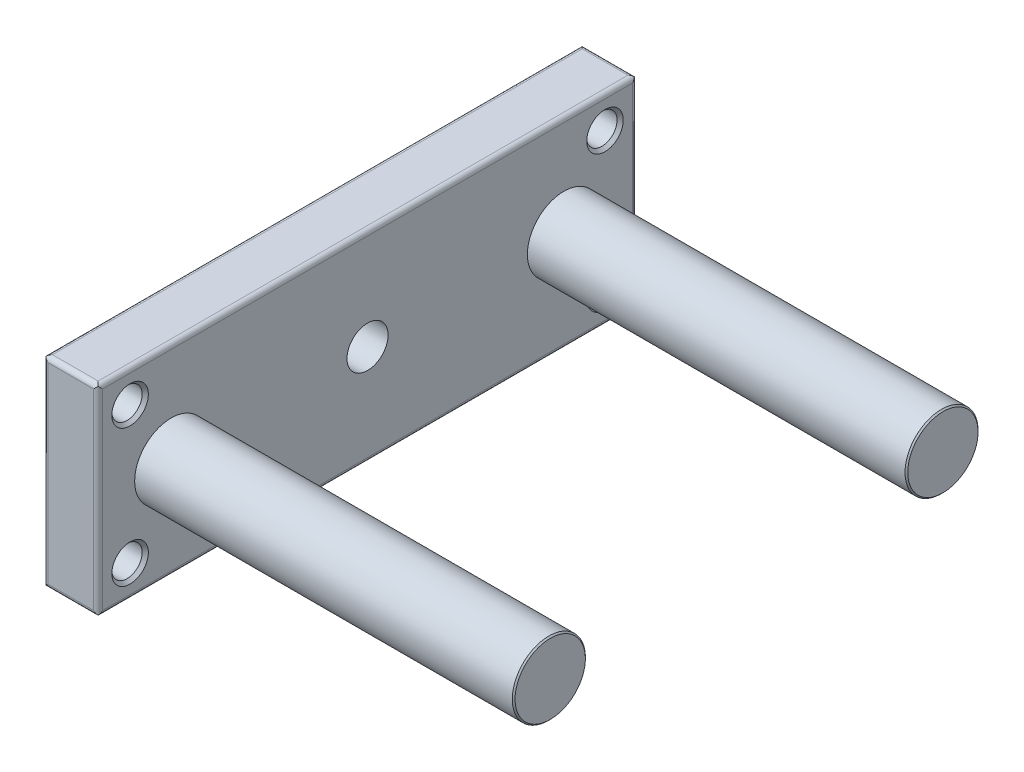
ISO-10303-21;
HEADER;
FILE_DESCRIPTION(('STEP AP214'),'2;1');
FILE_NAME('part.step','',(''),(''),'','','');
FILE_SCHEMA(('AUTOMOTIVE_DESIGN { 1 0 10303 214 1 1 1 1 }'));
ENDSEC;
DATA;
#1=APPLICATION_CONTEXT('core data for automotive mechanical design processes');
#2=APPLICATION_PROTOCOL_DEFINITION('international standard','automotive_design',2000,#1);
#3=PRODUCT_CONTEXT('',#1,'mechanical');
#4=PRODUCT('Part','Part','',(#3));
#5=PRODUCT_RELATED_PRODUCT_CATEGORY('part','',(#4));
#6=PRODUCT_DEFINITION_FORMATION('','',#4);
#7=PRODUCT_DEFINITION_CONTEXT('part definition',#1,'design');
#8=PRODUCT_DEFINITION('design','',#6,#7);
#9=PRODUCT_DEFINITION_SHAPE('','',#8);
#10=(LENGTH_UNIT() NAMED_UNIT(*) SI_UNIT(.MILLI.,.METRE.));
#11=(NAMED_UNIT(*) PLANE_ANGLE_UNIT() SI_UNIT($,.RADIAN.));
#12=(NAMED_UNIT(*) SI_UNIT($,.STERADIAN.) SOLID_ANGLE_UNIT());
#13=UNCERTAINTY_MEASURE_WITH_UNIT(LENGTH_MEASURE(1.E-05),#10,'distance_accuracy_value','');
#14=(GEOMETRIC_REPRESENTATION_CONTEXT(3) GLOBAL_UNCERTAINTY_ASSIGNED_CONTEXT((#13)) GLOBAL_UNIT_ASSIGNED_CONTEXT((#10,
#11,#12)) REPRESENTATION_CONTEXT('',''));
#15=CARTESIAN_POINT('',(0.,0.,0.));
#16=DIRECTION('',(0.,0.,1.));
#17=DIRECTION('',(1.,0.,0.));
#18=AXIS2_PLACEMENT_3D('',#15,#16,#17);
#19=CARTESIAN_POINT('',(2.,0.,0.));
#20=DIRECTION('',(1.,0.,0.));
#21=DIRECTION('',(0.,0.,-1.));
#22=AXIS2_PLACEMENT_3D('',#19,#20,#21);
#23=PLANE('',#22);
#24=DIRECTION('',(0.,-0.5,-0.866025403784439));
#25=VECTOR('',#24,1.);
#26=CARTESIAN_POINT('',(2.,1.44337567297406,-45.5));
#27=LINE('',#26,#25);
#28=CARTESIAN_POINT('',(2.,1.44337567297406,-45.5));
#29=VERTEX_POINT('',#28);
#30=CARTESIAN_POINT('',(2.,2.88675134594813,-43.));
#31=VERTEX_POINT('',#30);
#32=EDGE_CURVE('E256',#29,#31,#27,.F.);
#33=ORIENTED_EDGE('',*,*,#32,.F.);
#34=DIRECTION('',(0.,1.,0.));
#35=VECTOR('',#34,1.);
#36=CARTESIAN_POINT('',(2.,-1.44337567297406,-45.5));
#37=LINE('',#36,#35);
#38=CARTESIAN_POINT('',(2.,-1.44337567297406,-45.5));
#39=VERTEX_POINT('',#38);
#40=EDGE_CURVE('E253',#39,#29,#37,.T.);
#41=ORIENTED_EDGE('',*,*,#40,.F.);
#42=DIRECTION('',(0.,-0.5,0.866025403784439));
#43=VECTOR('',#42,1.);
#44=CARTESIAN_POINT('',(2.,-2.88675134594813,-43.));
#45=LINE('',#44,#43);
#46=CARTESIAN_POINT('',(2.,-2.88675134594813,-43.));
#47=VERTEX_POINT('',#46);
#48=EDGE_CURVE('E270',#47,#39,#45,.F.);
#49=ORIENTED_EDGE('',*,*,#48,.F.);
#50=DIRECTION('',(0.,0.500000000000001,0.866025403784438));
#51=VECTOR('',#50,1.);
#52=CARTESIAN_POINT('',(2.,-1.44337567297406,-40.5));
#53=LINE('',#52,#51);
#54=CARTESIAN_POINT('',(2.,-1.44337567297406,-40.5));
#55=VERTEX_POINT('',#54);
#56=EDGE_CURVE('E637',#55,#47,#53,.F.);
#57=ORIENTED_EDGE('',*,*,#56,.F.);
#58=DIRECTION('',(0.,1.,0.));
#59=VECTOR('',#58,1.);
#60=CARTESIAN_POINT('',(2.,1.44337567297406,-40.5));
#61=LINE('',#60,#59);
#62=CARTESIAN_POINT('',(2.,1.44337567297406,-40.5));
#63=VERTEX_POINT('',#62);
#64=EDGE_CURVE('E631',#63,#55,#61,.F.);
#65=ORIENTED_EDGE('',*,*,#64,.F.);
#66=DIRECTION('',(0.,0.500000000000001,-0.866025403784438));
#67=VECTOR('',#66,1.);
#68=CARTESIAN_POINT('',(2.,2.88675134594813,-43.));
#69=LINE('',#68,#67);
#70=EDGE_CURVE('E259',#31,#63,#69,.F.);
#71=ORIENTED_EDGE('',*,*,#70,.F.);
#72=EDGE_LOOP('',(#33,#41,#49,#57,#65,#71));
#73=FACE_BOUND('',#72,.T.);
#74=ADVANCED_FACE('F17',(#73),#23,.F.);
#75=CARTESIAN_POINT('',(2.,0.,0.));
#76=DIRECTION('',(1.,0.,0.));
#77=DIRECTION('',(0.,0.,-1.));
#78=AXIS2_PLACEMENT_3D('',#75,#76,#77);
#79=PLANE('',#78);
#80=DIRECTION('',(0.,-0.5,-0.866025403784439));
#81=VECTOR('',#80,1.);
#82=CARTESIAN_POINT('',(2.,1.44337567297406,40.5));
#83=LINE('',#82,#81);
#84=CARTESIAN_POINT('',(2.,1.44337567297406,40.5));
#85=VERTEX_POINT('',#84);
#86=CARTESIAN_POINT('',(2.,2.88675134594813,43.));
#87=VERTEX_POINT('',#86);
#88=EDGE_CURVE('E620',#85,#87,#83,.F.);
#89=ORIENTED_EDGE('',*,*,#88,.F.);
#90=DIRECTION('',(0.,1.,0.));
#91=VECTOR('',#90,1.);
#92=CARTESIAN_POINT('',(2.,-1.44337567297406,40.5));
#93=LINE('',#92,#91);
#94=CARTESIAN_POINT('',(2.,-1.44337567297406,40.5));
#95=VERTEX_POINT('',#94);
#96=EDGE_CURVE('E617',#95,#85,#93,.T.);
#97=ORIENTED_EDGE('',*,*,#96,.F.);
#98=DIRECTION('',(0.,-0.5,0.866025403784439));
#99=VECTOR('',#98,1.);
#100=CARTESIAN_POINT('',(2.,-2.88675134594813,43.));
#101=LINE('',#100,#99);
#102=CARTESIAN_POINT('',(2.,-2.88675134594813,43.));
#103=VERTEX_POINT('',#102);
#104=EDGE_CURVE('E611',#103,#95,#101,.F.);
#105=ORIENTED_EDGE('',*,*,#104,.F.);
#106=DIRECTION('',(0.,0.500000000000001,0.866025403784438));
#107=VECTOR('',#106,1.);
#108=CARTESIAN_POINT('',(2.,-1.44337567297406,45.5));
#109=LINE('',#108,#107);
#110=CARTESIAN_POINT('',(2.,-1.44337567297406,45.5));
#111=VERTEX_POINT('',#110);
#112=EDGE_CURVE('E605',#111,#103,#109,.F.);
#113=ORIENTED_EDGE('',*,*,#112,.F.);
#114=DIRECTION('',(0.,1.,0.));
#115=VECTOR('',#114,1.);
#116=CARTESIAN_POINT('',(2.,1.44337567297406,45.5));
#117=LINE('',#116,#115);
#118=CARTESIAN_POINT('',(2.,1.44337567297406,45.5));
#119=VERTEX_POINT('',#118);
#120=EDGE_CURVE('E599',#119,#111,#117,.F.);
#121=ORIENTED_EDGE('',*,*,#120,.F.);
#122=DIRECTION('',(0.,0.500000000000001,-0.866025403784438));
#123=VECTOR('',#122,1.);
#124=CARTESIAN_POINT('',(2.,2.88675134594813,43.));
#125=LINE('',#124,#123);
#126=EDGE_CURVE('E590',#87,#119,#125,.F.);
#127=ORIENTED_EDGE('',*,*,#126,.F.);
#128=EDGE_LOOP('',(#89,#97,#105,#113,#121,#127));
#129=FACE_BOUND('',#128,.T.);
#130=ADVANCED_FACE('F1398',(#129),#79,.F.);
#131=CARTESIAN_POINT('',(2.,1.44337567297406,-45.5));
#132=DIRECTION('',(0.,-0.866025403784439,0.5));
#133=DIRECTION('',(0.,-0.5,-0.866025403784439));
#134=AXIS2_PLACEMENT_3D('',#131,#132,#133);
#135=PLANE('',#134);
#136=ORIENTED_EDGE('',*,*,#32,.T.);
#137=DIRECTION('',(1.,0.,0.));
#138=VECTOR('',#137,1.);
#139=CARTESIAN_POINT('',(2.,2.88675134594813,-43.));
#140=LINE('',#139,#138);
#141=CARTESIAN_POINT('',(0.,2.88675134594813,-43.));
#142=VERTEX_POINT('',#141);
#143=EDGE_CURVE('E626',#142,#31,#140,.T.);
#144=ORIENTED_EDGE('',*,*,#143,.F.);
#145=DIRECTION('',(0.,-0.500000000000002,-0.866025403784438));
#146=VECTOR('',#145,1.);
#147=CARTESIAN_POINT('',(0.,2.88675134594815,-43.));
#148=LINE('',#147,#146);
#149=CARTESIAN_POINT('',(0.,1.44337567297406,-45.5));
#150=VERTEX_POINT('',#149);
#151=EDGE_CURVE('E267',#142,#150,#148,.T.);
#152=ORIENTED_EDGE('',*,*,#151,.T.);
#153=DIRECTION('',(1.,0.,0.));
#154=VECTOR('',#153,1.);
#155=CARTESIAN_POINT('',(2.,1.44337567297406,-45.5));
#156=LINE('',#155,#154);
#157=EDGE_CURVE('E264',#29,#150,#156,.F.);
#158=ORIENTED_EDGE('',*,*,#157,.F.);
#159=EDGE_LOOP('',(#136,#144,#152,#158));
#160=FACE_BOUND('',#159,.T.);
#161=ADVANCED_FACE('F265',(#160),#135,.T.);
#162=CARTESIAN_POINT('',(2.,-1.44337567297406,-45.5));
#163=DIRECTION('',(0.,0.,1.));
#164=DIRECTION('',(1.,0.,0.));
#165=AXIS2_PLACEMENT_3D('',#162,#163,#164);
#166=PLANE('',#165);
#167=ORIENTED_EDGE('',*,*,#40,.T.);
#168=ORIENTED_EDGE('',*,*,#157,.T.);
#169=DIRECTION('',(0.,1.,0.));
#170=VECTOR('',#169,1.);
#171=CARTESIAN_POINT('',(0.,21.,-45.5));
#172=LINE('',#171,#170);
#173=CARTESIAN_POINT('',(0.,-1.44337567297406,-45.5));
#174=VERTEX_POINT('',#173);
#175=EDGE_CURVE('E574',#150,#174,#172,.F.);
#176=ORIENTED_EDGE('',*,*,#175,.T.);
#177=DIRECTION('',(1.,0.,0.));
#178=VECTOR('',#177,1.);
#179=CARTESIAN_POINT('',(2.,-1.44337567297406,-45.5));
#180=LINE('',#179,#178);
#181=EDGE_CURVE('E274',#39,#174,#180,.F.);
#182=ORIENTED_EDGE('',*,*,#181,.F.);
#183=EDGE_LOOP('',(#167,#168,#176,#182));
#184=FACE_BOUND('',#183,.T.);
#185=ADVANCED_FACE('F272',(#184),#166,.T.);
#186=CARTESIAN_POINT('',(2.,-2.88675134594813,-43.));
#187=DIRECTION('',(0.,0.866025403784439,0.5));
#188=DIRECTION('',(0.,-0.5,0.866025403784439));
#189=AXIS2_PLACEMENT_3D('',#186,#187,#188);
#190=PLANE('',#189);
#191=ORIENTED_EDGE('',*,*,#48,.T.);
#192=ORIENTED_EDGE('',*,*,#181,.T.);
#193=DIRECTION('',(0.,-0.499999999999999,0.866025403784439));
#194=VECTOR('',#193,1.);
#195=CARTESIAN_POINT('',(0.,-1.44337567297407,-45.5));
#196=LINE('',#195,#194);
#197=CARTESIAN_POINT('',(0.,-2.88675134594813,-43.));
#198=VERTEX_POINT('',#197);
#199=EDGE_CURVE('E572',#174,#198,#196,.T.);
#200=ORIENTED_EDGE('',*,*,#199,.T.);
#201=DIRECTION('',(1.,0.,0.));
#202=VECTOR('',#201,1.);
#203=CARTESIAN_POINT('',(2.,-2.88675134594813,-43.));
#204=LINE('',#203,#202);
#205=EDGE_CURVE('E634',#47,#198,#204,.F.);
#206=ORIENTED_EDGE('',*,*,#205,.F.);
#207=EDGE_LOOP('',(#191,#192,#200,#206));
#208=FACE_BOUND('',#207,.T.);
#209=ADVANCED_FACE('F642',(#208),#190,.T.);
#210=CARTESIAN_POINT('',(2.,-1.44337567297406,-40.5));
#211=DIRECTION('',(0.,0.866025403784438,-0.500000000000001));
#212=DIRECTION('',(0.,0.500000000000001,0.866025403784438));
#213=AXIS2_PLACEMENT_3D('',#210,#211,#212);
#214=PLANE('',#213);
#215=ORIENTED_EDGE('',*,*,#56,.T.);
#216=ORIENTED_EDGE('',*,*,#205,.T.);
#217=DIRECTION('',(0.,0.499999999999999,0.866025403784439));
#218=VECTOR('',#217,1.);
#219=CARTESIAN_POINT('',(0.,-2.88675134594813,-43.));
#220=LINE('',#219,#218);
#221=CARTESIAN_POINT('',(0.,-1.44337567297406,-40.5));
#222=VERTEX_POINT('',#221);
#223=EDGE_CURVE('E570',#198,#222,#220,.T.);
#224=ORIENTED_EDGE('',*,*,#223,.T.);
#225=DIRECTION('',(-1.,0.,0.));
#226=VECTOR('',#225,1.);
#227=CARTESIAN_POINT('',(2.,-1.44337567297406,-40.5));
#228=LINE('',#227,#226);
#229=EDGE_CURVE('E628',#55,#222,#228,.T.);
#230=ORIENTED_EDGE('',*,*,#229,.F.);
#231=EDGE_LOOP('',(#215,#216,#224,#230));
#232=FACE_BOUND('',#231,.T.);
#233=ADVANCED_FACE('F647',(#232),#214,.T.);
#234=CARTESIAN_POINT('',(2.,1.44337567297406,-40.5));
#235=DIRECTION('',(0.,0.,-1.));
#236=DIRECTION('',(-1.,0.,0.));
#237=AXIS2_PLACEMENT_3D('',#234,#235,#236);
#238=PLANE('',#237);
#239=ORIENTED_EDGE('',*,*,#64,.T.);
#240=ORIENTED_EDGE('',*,*,#229,.T.);
#241=DIRECTION('',(0.,1.,0.));
#242=VECTOR('',#241,1.);
#243=CARTESIAN_POINT('',(0.,21.,-40.5));
#244=LINE('',#243,#242);
#245=CARTESIAN_POINT('',(0.,1.44337567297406,-40.5));
#246=VERTEX_POINT('',#245);
#247=EDGE_CURVE('E568',#222,#246,#244,.T.);
#248=ORIENTED_EDGE('',*,*,#247,.T.);
#249=DIRECTION('',(1.,0.,0.));
#250=VECTOR('',#249,1.);
#251=CARTESIAN_POINT('',(2.,1.44337567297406,-40.5));
#252=LINE('',#251,#250);
#253=EDGE_CURVE('E622',#63,#246,#252,.F.);
#254=ORIENTED_EDGE('',*,*,#253,.F.);
#255=EDGE_LOOP('',(#239,#240,#248,#254));
#256=FACE_BOUND('',#255,.T.);
#257=ADVANCED_FACE('F651',(#256),#238,.T.);
#258=CARTESIAN_POINT('',(2.,2.88675134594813,-43.));
#259=DIRECTION('',(0.,-0.866025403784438,-0.500000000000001));
#260=DIRECTION('',(0.,0.500000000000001,-0.866025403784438));
#261=AXIS2_PLACEMENT_3D('',#258,#259,#260);
#262=PLANE('',#261);
#263=ORIENTED_EDGE('',*,*,#70,.T.);
#264=ORIENTED_EDGE('',*,*,#253,.T.);
#265=DIRECTION('',(0.,0.500000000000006,-0.866025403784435));
#266=VECTOR('',#265,1.);
#267=CARTESIAN_POINT('',(0.,1.44337567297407,-40.5));
#268=LINE('',#267,#266);
#269=EDGE_CURVE('E535',#246,#142,#268,.T.);
#270=ORIENTED_EDGE('',*,*,#269,.T.);
#271=ORIENTED_EDGE('',*,*,#143,.T.);
#272=EDGE_LOOP('',(#263,#264,#270,#271));
#273=FACE_BOUND('',#272,.T.);
#274=ADVANCED_FACE('F654',(#273),#262,.T.);
#275=CARTESIAN_POINT('',(2.,1.44337567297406,40.5));
#276=DIRECTION('',(0.,-0.866025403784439,0.5));
#277=DIRECTION('',(0.,-0.5,-0.866025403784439));
#278=AXIS2_PLACEMENT_3D('',#275,#276,#277);
#279=PLANE('',#278);
#280=ORIENTED_EDGE('',*,*,#88,.T.);
#281=DIRECTION('',(1.,0.,0.));
#282=VECTOR('',#281,1.);
#283=CARTESIAN_POINT('',(2.,2.88675134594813,43.));
#284=LINE('',#283,#282);
#285=CARTESIAN_POINT('',(0.,2.88675134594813,43.));
#286=VERTEX_POINT('',#285);
#287=EDGE_CURVE('E593',#286,#87,#284,.T.);
#288=ORIENTED_EDGE('',*,*,#287,.F.);
#289=DIRECTION('',(0.,-0.5,-0.866025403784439));
#290=VECTOR('',#289,1.);
#291=CARTESIAN_POINT('',(0.,2.88675134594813,43.));
#292=LINE('',#291,#290);
#293=CARTESIAN_POINT('',(0.,1.44337567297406,40.5));
#294=VERTEX_POINT('',#293);
#295=EDGE_CURVE('E533',#286,#294,#292,.T.);
#296=ORIENTED_EDGE('',*,*,#295,.T.);
#297=DIRECTION('',(1.,0.,0.));
#298=VECTOR('',#297,1.);
#299=CARTESIAN_POINT('',(2.,1.44337567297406,40.5));
#300=LINE('',#299,#298);
#301=EDGE_CURVE('E614',#85,#294,#300,.F.);
#302=ORIENTED_EDGE('',*,*,#301,.F.);
#303=EDGE_LOOP('',(#280,#288,#296,#302));
#304=FACE_BOUND('',#303,.T.);
#305=ADVANCED_FACE('F1346',(#304),#279,.T.);
#306=CARTESIAN_POINT('',(2.,-1.44337567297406,40.5));
#307=DIRECTION('',(0.,0.,1.));
#308=DIRECTION('',(1.,0.,0.));
#309=AXIS2_PLACEMENT_3D('',#306,#307,#308);
#310=PLANE('',#309);
#311=ORIENTED_EDGE('',*,*,#96,.T.);
#312=ORIENTED_EDGE('',*,*,#301,.T.);
#313=DIRECTION('',(0.,1.,0.));
#314=VECTOR('',#313,1.);
#315=CARTESIAN_POINT('',(0.,21.,40.5));
#316=LINE('',#315,#314);
#317=CARTESIAN_POINT('',(0.,-1.44337567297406,40.5));
#318=VERTEX_POINT('',#317);
#319=EDGE_CURVE('E531',#294,#318,#316,.F.);
#320=ORIENTED_EDGE('',*,*,#319,.T.);
#321=DIRECTION('',(1.,0.,0.));
#322=VECTOR('',#321,1.);
#323=CARTESIAN_POINT('',(2.,-1.44337567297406,40.5));
#324=LINE('',#323,#322);
#325=EDGE_CURVE('E608',#95,#318,#324,.F.);
#326=ORIENTED_EDGE('',*,*,#325,.F.);
#327=EDGE_LOOP('',(#311,#312,#320,#326));
#328=FACE_BOUND('',#327,.T.);
#329=ADVANCED_FACE('F1337',(#328),#310,.T.);
#330=CARTESIAN_POINT('',(2.,-2.88675134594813,43.));
#331=DIRECTION('',(0.,0.866025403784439,0.5));
#332=DIRECTION('',(0.,-0.5,0.866025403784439));
#333=AXIS2_PLACEMENT_3D('',#330,#331,#332);
#334=PLANE('',#333);
#335=ORIENTED_EDGE('',*,*,#104,.T.);
#336=ORIENTED_EDGE('',*,*,#325,.T.);
#337=DIRECTION('',(0.,-0.499999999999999,0.866025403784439));
#338=VECTOR('',#337,1.);
#339=CARTESIAN_POINT('',(0.,-1.44337567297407,40.5));
#340=LINE('',#339,#338);
#341=CARTESIAN_POINT('',(0.,-2.88675134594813,43.));
#342=VERTEX_POINT('',#341);
#343=EDGE_CURVE('E529',#318,#342,#340,.T.);
#344=ORIENTED_EDGE('',*,*,#343,.T.);
#345=DIRECTION('',(1.,0.,0.));
#346=VECTOR('',#345,1.);
#347=CARTESIAN_POINT('',(2.,-2.88675134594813,43.));
#348=LINE('',#347,#346);
#349=EDGE_CURVE('E602',#103,#342,#348,.F.);
#350=ORIENTED_EDGE('',*,*,#349,.F.);
#351=EDGE_LOOP('',(#335,#336,#344,#350));
#352=FACE_BOUND('',#351,.T.);
#353=ADVANCED_FACE('F1328',(#352),#334,.T.);
#354=CARTESIAN_POINT('',(2.,-1.44337567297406,45.5));
#355=DIRECTION('',(0.,0.866025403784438,-0.500000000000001));
#356=DIRECTION('',(0.,0.500000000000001,0.866025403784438));
#357=AXIS2_PLACEMENT_3D('',#354,#355,#356);
#358=PLANE('',#357);
#359=ORIENTED_EDGE('',*,*,#112,.T.);
#360=ORIENTED_EDGE('',*,*,#349,.T.);
#361=DIRECTION('',(0.,0.5,0.866025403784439));
#362=VECTOR('',#361,1.);
#363=CARTESIAN_POINT('',(0.,-2.88675134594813,43.));
#364=LINE('',#363,#362);
#365=CARTESIAN_POINT('',(0.,-1.44337567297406,45.5));
#366=VERTEX_POINT('',#365);
#367=EDGE_CURVE('E527',#342,#366,#364,.T.);
#368=ORIENTED_EDGE('',*,*,#367,.T.);
#369=DIRECTION('',(-1.,0.,0.));
#370=VECTOR('',#369,1.);
#371=CARTESIAN_POINT('',(2.,-1.44337567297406,45.5));
#372=LINE('',#371,#370);
#373=EDGE_CURVE('E596',#111,#366,#372,.T.);
#374=ORIENTED_EDGE('',*,*,#373,.F.);
#375=EDGE_LOOP('',(#359,#360,#368,#374));
#376=FACE_BOUND('',#375,.T.);
#377=ADVANCED_FACE('F1319',(#376),#358,.T.);
#378=CARTESIAN_POINT('',(2.,1.44337567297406,45.5));
#379=DIRECTION('',(0.,0.,-1.));
#380=DIRECTION('',(-1.,0.,0.));
#381=AXIS2_PLACEMENT_3D('',#378,#379,#380);
#382=PLANE('',#381);
#383=ORIENTED_EDGE('',*,*,#120,.T.);
#384=ORIENTED_EDGE('',*,*,#373,.T.);
#385=DIRECTION('',(0.,1.,0.));
#386=VECTOR('',#385,1.);
#387=CARTESIAN_POINT('',(0.,21.,45.5));
#388=LINE('',#387,#386);
#389=CARTESIAN_POINT('',(0.,1.44337567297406,45.5));
#390=VERTEX_POINT('',#389);
#391=EDGE_CURVE('E525',#366,#390,#388,.T.);
#392=ORIENTED_EDGE('',*,*,#391,.T.);
#393=DIRECTION('',(1.,0.,0.));
#394=VECTOR('',#393,1.);
#395=CARTESIAN_POINT('',(2.,1.44337567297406,45.5));
#396=LINE('',#395,#394);
#397=EDGE_CURVE('E577',#119,#390,#396,.F.);
#398=ORIENTED_EDGE('',*,*,#397,.F.);
#399=EDGE_LOOP('',(#383,#384,#392,#398));
#400=FACE_BOUND('',#399,.T.);
#401=ADVANCED_FACE('F662',(#400),#382,.T.);
#402=CARTESIAN_POINT('',(2.,2.88675134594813,43.));
#403=DIRECTION('',(0.,-0.866025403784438,-0.500000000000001));
#404=DIRECTION('',(0.,0.500000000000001,-0.866025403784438));
#405=AXIS2_PLACEMENT_3D('',#402,#403,#404);
#406=PLANE('',#405);
#407=ORIENTED_EDGE('',*,*,#126,.T.);
#408=ORIENTED_EDGE('',*,*,#397,.T.);
#409=DIRECTION('',(0.,0.500000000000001,-0.866025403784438));
#410=VECTOR('',#409,1.);
#411=CARTESIAN_POINT('',(0.,1.44337567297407,45.5));
#412=LINE('',#411,#410);
#413=EDGE_CURVE('E516',#390,#286,#412,.T.);
#414=ORIENTED_EDGE('',*,*,#413,.T.);
#415=ORIENTED_EDGE('',*,*,#287,.T.);
#416=EDGE_LOOP('',(#407,#408,#414,#415));
#417=FACE_BOUND('',#416,.T.);
#418=ADVANCED_FACE('F657',(#417),#406,.T.);
#419=CARTESIAN_POINT('',(0.,21.,58.));
#420=DIRECTION('',(1.,0.,0.));
#421=DIRECTION('',(0.,0.,-1.));
#422=AXIS2_PLACEMENT_3D('',#419,#420,#421);
#423=PLANE('',#422);
#424=ORIENTED_EDGE('',*,*,#247,.F.);
#425=ORIENTED_EDGE('',*,*,#223,.F.);
#426=ORIENTED_EDGE('',*,*,#199,.F.);
#427=ORIENTED_EDGE('',*,*,#175,.F.);
#428=ORIENTED_EDGE('',*,*,#151,.F.);
#429=ORIENTED_EDGE('',*,*,#269,.F.);
#430=EDGE_LOOP('',(#424,#425,#426,#427,#428,#429));
#431=FACE_BOUND('',#430,.T.);
#432=CARTESIAN_POINT('',(0.,0.,-43.));
#433=DIRECTION('',(1.,0.,0.));
#434=DIRECTION('',(0.,0.,1.));
#435=AXIS2_PLACEMENT_3D('',#432,#433,#434);
#436=CIRCLE('',#435,6.);
#437=CARTESIAN_POINT('',(0.,0.,-37.));
#438=VERTEX_POINT('',#437);
#439=CARTESIAN_POINT('',(0.,0.,-49.));
#440=VERTEX_POINT('',#439);
#441=EDGE_CURVE('E548',#438,#440,#436,.T.);
#442=ORIENTED_EDGE('',*,*,#441,.F.);
#443=CARTESIAN_POINT('',(0.,0.,-43.));
#444=DIRECTION('',(1.,0.,0.));
#445=DIRECTION('',(0.,0.,-1.));
#446=AXIS2_PLACEMENT_3D('',#443,#444,#445);
#447=CIRCLE('',#446,6.);
#448=EDGE_CURVE('E524',#440,#438,#447,.T.);
#449=ORIENTED_EDGE('',*,*,#448,.F.);
#450=EDGE_LOOP('',(#442,#449));
#451=FACE_BOUND('',#450,.T.);
#452=ADVANCED_FACE('F508',(#431,#451),#423,.F.);
#453=CARTESIAN_POINT('',(0.,21.,58.));
#454=DIRECTION('',(1.,0.,0.));
#455=DIRECTION('',(0.,0.,-1.));
#456=AXIS2_PLACEMENT_3D('',#453,#454,#455);
#457=PLANE('',#456);
#458=ORIENTED_EDGE('',*,*,#391,.F.);
#459=ORIENTED_EDGE('',*,*,#367,.F.);
#460=ORIENTED_EDGE('',*,*,#343,.F.);
#461=ORIENTED_EDGE('',*,*,#319,.F.);
#462=ORIENTED_EDGE('',*,*,#295,.F.);
#463=ORIENTED_EDGE('',*,*,#413,.F.);
#464=EDGE_LOOP('',(#458,#459,#460,#461,#462,#463));
#465=FACE_BOUND('',#464,.T.);
#466=CARTESIAN_POINT('',(0.,0.,43.));
#467=DIRECTION('',(1.,0.,0.));
#468=DIRECTION('',(0.,0.,1.));
#469=AXIS2_PLACEMENT_3D('',#466,#467,#468);
#470=CIRCLE('',#469,6.);
#471=CARTESIAN_POINT('',(0.,0.,49.));
#472=VERTEX_POINT('',#471);
#473=CARTESIAN_POINT('',(0.,0.,37.));
#474=VERTEX_POINT('',#473);
#475=EDGE_CURVE('E492',#472,#474,#470,.T.);
#476=ORIENTED_EDGE('',*,*,#475,.F.);
#477=CARTESIAN_POINT('',(0.,0.,43.));
#478=DIRECTION('',(1.,0.,0.));
#479=DIRECTION('',(0.,0.,-1.));
#480=AXIS2_PLACEMENT_3D('',#477,#478,#479);
#481=CIRCLE('',#480,6.);
#482=EDGE_CURVE('E457',#474,#472,#481,.T.);
#483=ORIENTED_EDGE('',*,*,#482,.F.);
#484=EDGE_LOOP('',(#476,#483));
#485=FACE_BOUND('',#484,.T.);
#486=ADVANCED_FACE('F499',(#465,#485),#457,.F.);
#487=CARTESIAN_POINT('',(0.5,0.,-43.));
#488=DIRECTION('',(-1.,0.,0.));
#489=DIRECTION('',(0.,0.,1.));
#490=AXIS2_PLACEMENT_3D('',#487,#488,#489);
#491=TOROIDAL_SURFACE('',#490,6.,0.5);
#492=CARTESIAN_POINT('',(0.5,0.,-43.));
#493=DIRECTION('',(-1.,0.,0.));
#494=DIRECTION('',(0.,0.,1.));
#495=AXIS2_PLACEMENT_3D('',#492,#493,#494);
#496=CIRCLE('',#495,6.5);
#497=CARTESIAN_POINT('',(0.5,0.,-36.5));
#498=VERTEX_POINT('',#497);
#499=EDGE_CURVE('E487',#498,#498,#496,.F.);
#500=ORIENTED_EDGE('',*,*,#499,.F.);
#501=EDGE_LOOP('',(#500));
#502=FACE_BOUND('',#501,.T.);
#503=ORIENTED_EDGE('',*,*,#441,.T.);
#504=ORIENTED_EDGE('',*,*,#448,.T.);
#505=EDGE_LOOP('',(#503,#504));
#506=FACE_BOUND('',#505,.T.);
#507=ADVANCED_FACE('F473',(#502,#506),#491,.T.);
#508=CARTESIAN_POINT('',(0.5,0.,43.));
#509=DIRECTION('',(-1.,0.,0.));
#510=DIRECTION('',(0.,0.,1.));
#511=AXIS2_PLACEMENT_3D('',#508,#509,#510);
#512=TOROIDAL_SURFACE('',#511,6.,0.5);
#513=CARTESIAN_POINT('',(0.5,0.,43.));
#514=DIRECTION('',(-1.,0.,0.));
#515=DIRECTION('',(0.,0.,1.));
#516=AXIS2_PLACEMENT_3D('',#513,#514,#515);
#517=CIRCLE('',#516,6.5);
#518=CARTESIAN_POINT('',(0.5,0.,49.5));
#519=VERTEX_POINT('',#518);
#520=EDGE_CURVE('E485',#519,#519,#517,.F.);
#521=ORIENTED_EDGE('',*,*,#520,.F.);
#522=EDGE_LOOP('',(#521));
#523=FACE_BOUND('',#522,.T.);
#524=ORIENTED_EDGE('',*,*,#475,.T.);
#525=ORIENTED_EDGE('',*,*,#482,.T.);
#526=EDGE_LOOP('',(#524,#525));
#527=FACE_BOUND('',#526,.T.);
#528=ADVANCED_FACE('F462',(#523,#527),#512,.T.);
#529=CARTESIAN_POINT('',(6.00000000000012,0.,-25.));
#530=DIRECTION('',(-1.,0.,0.));
#531=DIRECTION('',(0.,0.,1.));
#532=AXIS2_PLACEMENT_3D('',#529,#530,#531);
#533=CONICAL_SURFACE('',#532,1.99999999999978,1.04719755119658);
#534=CARTESIAN_POINT('',(7.15470053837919,0.,-25.));
#535=VERTEX_POINT('',#534);
#536=VERTEX_LOOP('',#535);
#537=FACE_BOUND('',#536,.T.);
#538=CARTESIAN_POINT('',(6.,0.,-25.));
#539=DIRECTION('',(-1.,0.,0.));
#540=DIRECTION('',(0.,-1.,0.));
#541=AXIS2_PLACEMENT_3D('',#538,#539,#540);
#542=CIRCLE('',#541,2.);
#543=CARTESIAN_POINT('',(6.,-2.,-25.));
#544=VERTEX_POINT('',#543);
#545=EDGE_CURVE('E453',#544,#544,#542,.T.);
#546=ORIENTED_EDGE('',*,*,#545,.T.);
#547=EDGE_LOOP('',(#546));
#548=FACE_BOUND('',#547,.T.);
#549=ADVANCED_FACE('F472',(#537,#548),#533,.F.);
#550=CARTESIAN_POINT('',(5.5,0.,-43.));
#551=DIRECTION('',(-1.,0.,0.));
#552=DIRECTION('',(0.,0.,1.));
#553=AXIS2_PLACEMENT_3D('',#550,#551,#552);
#554=CYLINDRICAL_SURFACE('',#553,6.5);
#555=CARTESIAN_POINT('',(5.5,0.,-43.));
#556=DIRECTION('',(-1.,0.,0.));
#557=DIRECTION('',(0.,0.,1.));
#558=AXIS2_PLACEMENT_3D('',#555,#556,#557);
#559=CIRCLE('',#558,6.5);
#560=CARTESIAN_POINT('',(5.5,0.,-36.5));
#561=VERTEX_POINT('',#560);
#562=EDGE_CURVE('E450',#561,#561,#559,.F.);
#563=ORIENTED_EDGE('',*,*,#562,.F.);
#564=EDGE_LOOP('',(#563));
#565=FACE_BOUND('',#564,.T.);
#566=ORIENTED_EDGE('',*,*,#499,.T.);
#567=EDGE_LOOP('',(#566));
#568=FACE_BOUND('',#567,.T.);
#569=ADVANCED_FACE('F888',(#565,#568),#554,.T.);
#570=CARTESIAN_POINT('',(5.5,0.,43.));
#571=DIRECTION('',(-1.,0.,0.));
#572=DIRECTION('',(0.,0.,1.));
#573=AXIS2_PLACEMENT_3D('',#570,#571,#572);
#574=CYLINDRICAL_SURFACE('',#573,6.5);
#575=CARTESIAN_POINT('',(5.5,0.,43.));
#576=DIRECTION('',(-1.,0.,0.));
#577=DIRECTION('',(0.,0.,1.));
#578=AXIS2_PLACEMENT_3D('',#575,#576,#577);
#579=CIRCLE('',#578,6.5);
#580=CARTESIAN_POINT('',(5.5,0.,49.5));
#581=VERTEX_POINT('',#580);
#582=EDGE_CURVE('E447',#581,#581,#579,.F.);
#583=ORIENTED_EDGE('',*,*,#582,.F.);
#584=EDGE_LOOP('',(#583));
#585=FACE_BOUND('',#584,.T.);
#586=ORIENTED_EDGE('',*,*,#520,.T.);
#587=EDGE_LOOP('',(#586));
#588=FACE_BOUND('',#587,.T.);
#589=ADVANCED_FACE('F886',(#585,#588),#574,.T.);
#590=CARTESIAN_POINT('',(7.15470053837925,0.,-25.));
#591=DIRECTION('',(-1.,0.,0.));
#592=DIRECTION('',(0.,-1.,0.));
#593=AXIS2_PLACEMENT_3D('',#590,#591,#592);
#594=CYLINDRICAL_SURFACE('',#593,2.);
#595=CARTESIAN_POINT('',(3.,0.,-25.));
#596=DIRECTION('',(-1.,0.,0.));
#597=DIRECTION('',(0.,-1.,0.));
#598=AXIS2_PLACEMENT_3D('',#595,#596,#597);
#599=CIRCLE('',#598,2.);
#600=CARTESIAN_POINT('',(3.,2.,-25.));
#601=VERTEX_POINT('',#600);
#602=CARTESIAN_POINT('',(3.,-2.,-25.));
#603=VERTEX_POINT('',#602);
#604=EDGE_CURVE('E162',#601,#603,#599,.T.);
#605=ORIENTED_EDGE('',*,*,#604,.T.);
#606=CARTESIAN_POINT('',(3.,0.,-25.));
#607=DIRECTION('',(-1.,0.,0.));
#608=DIRECTION('',(0.,-1.,0.));
#609=AXIS2_PLACEMENT_3D('',#606,#607,#608);
#610=CIRCLE('',#609,2.);
#611=EDGE_CURVE('E165',#603,#601,#610,.T.);
#612=ORIENTED_EDGE('',*,*,#611,.T.);
#613=EDGE_LOOP('',(#605,#612));
#614=FACE_BOUND('',#613,.T.);
#615=ORIENTED_EDGE('',*,*,#545,.F.);
#616=EDGE_LOOP('',(#615));
#617=FACE_BOUND('',#616,.T.);
#618=ADVANCED_FACE('F882',(#614,#617),#594,.F.);
#619=CARTESIAN_POINT('',(5.5,6.5,-43.));
#620=DIRECTION('',(-1.,0.,0.));
#621=DIRECTION('',(0.,0.,1.));
#622=AXIS2_PLACEMENT_3D('',#619,#620,#621);
#623=PLANE('',#622);
#624=ORIENTED_EDGE('',*,*,#562,.T.);
#625=EDGE_LOOP('',(#624));
#626=FACE_BOUND('',#625,.T.);
#627=CARTESIAN_POINT('',(5.5,0.,-43.));
#628=DIRECTION('',(-1.,0.,0.));
#629=DIRECTION('',(0.,0.,1.));
#630=AXIS2_PLACEMENT_3D('',#627,#628,#629);
#631=CIRCLE('',#630,7.5);
#632=CARTESIAN_POINT('',(5.5,0.,-35.5));
#633=VERTEX_POINT('',#632);
#634=EDGE_CURVE('E438',#633,#633,#631,.T.);
#635=ORIENTED_EDGE('',*,*,#634,.T.);
#636=EDGE_LOOP('',(#635));
#637=FACE_BOUND('',#636,.T.);
#638=ADVANCED_FACE('F878',(#626,#637),#623,.T.);
#639=CARTESIAN_POINT('',(5.5,6.5,43.));
#640=DIRECTION('',(-1.,0.,0.));
#641=DIRECTION('',(0.,0.,1.));
#642=AXIS2_PLACEMENT_3D('',#639,#640,#641);
#643=PLANE('',#642);
#644=ORIENTED_EDGE('',*,*,#582,.T.);
#645=EDGE_LOOP('',(#644));
#646=FACE_BOUND('',#645,.T.);
#647=CARTESIAN_POINT('',(5.5,0.,43.));
#648=DIRECTION('',(-1.,0.,0.));
#649=DIRECTION('',(0.,0.,1.));
#650=AXIS2_PLACEMENT_3D('',#647,#648,#649);
#651=CIRCLE('',#650,7.5);
#652=CARTESIAN_POINT('',(5.5,0.,50.5));
#653=VERTEX_POINT('',#652);
#654=EDGE_CURVE('E434',#653,#653,#651,.T.);
#655=ORIENTED_EDGE('',*,*,#654,.T.);
#656=EDGE_LOOP('',(#655));
#657=FACE_BOUND('',#656,.T.);
#658=ADVANCED_FACE('F874',(#646,#657),#643,.T.);
#659=CARTESIAN_POINT('',(3.,0.,-24.7));
#660=DIRECTION('',(1.,0.,0.));
#661=DIRECTION('',(0.,0.,-1.));
#662=AXIS2_PLACEMENT_3D('',#659,#660,#661);
#663=PLANE('',#662);
#664=DIRECTION('',(0.,0.,1.));
#665=VECTOR('',#664,1.);
#666=CARTESIAN_POINT('',(3.,-2.,-24.7));
#667=LINE('',#666,#665);
#668=CARTESIAN_POINT('',(3.,-2.,-24.7));
#669=VERTEX_POINT('',#668);
#670=EDGE_CURVE('E443',#669,#603,#667,.F.);
#671=ORIENTED_EDGE('',*,*,#670,.F.);
#672=CARTESIAN_POINT('',(3.,0.,-24.7));
#673=DIRECTION('',(-1.,0.,0.));
#674=DIRECTION('',(0.,0.,1.));
#675=AXIS2_PLACEMENT_3D('',#672,#673,#674);
#676=CIRCLE('',#675,2.);
#677=CARTESIAN_POINT('',(3.,2.,-24.7));
#678=VERTEX_POINT('',#677);
#679=EDGE_CURVE('E430',#669,#678,#676,.T.);
#680=ORIENTED_EDGE('',*,*,#679,.T.);
#681=DIRECTION('',(0.,0.,-1.));
#682=VECTOR('',#681,1.);
#683=CARTESIAN_POINT('',(3.,2.,-25.3));
#684=LINE('',#683,#682);
#685=EDGE_CURVE('E446',#601,#678,#684,.F.);
#686=ORIENTED_EDGE('',*,*,#685,.F.);
#687=ORIENTED_EDGE('',*,*,#611,.F.);
#688=EDGE_LOOP('',(#671,#680,#686,#687));
#689=FACE_BOUND('',#688,.T.);
#690=ADVANCED_FACE('F870',(#689),#663,.F.);
#691=CARTESIAN_POINT('',(3.,2.,-25.3));
#692=DIRECTION('',(0.,-1.,0.));
#693=DIRECTION('',(0.,0.,-1.));
#694=AXIS2_PLACEMENT_3D('',#691,#692,#693);
#695=PLANE('',#694);
#696=DIRECTION('',(0.,0.,-1.));
#697=VECTOR('',#696,1.);
#698=CARTESIAN_POINT('',(0.,2.,-25.3));
#699=LINE('',#698,#697);
#700=CARTESIAN_POINT('',(0.,2.,-24.7));
#701=VERTEX_POINT('',#700);
#702=CARTESIAN_POINT('',(0.,2.,-25.3));
#703=VERTEX_POINT('',#702);
#704=EDGE_CURVE('E1459',#701,#703,#699,.T.);
#705=ORIENTED_EDGE('',*,*,#704,.T.);
#706=DIRECTION('',(-1.,0.,0.));
#707=VECTOR('',#706,1.);
#708=CARTESIAN_POINT('',(3.,2.,-25.3));
#709=LINE('',#708,#707);
#710=CARTESIAN_POINT('',(3.,2.,-25.3));
#711=VERTEX_POINT('',#710);
#712=EDGE_CURVE('E429',#703,#711,#709,.F.);
#713=ORIENTED_EDGE('',*,*,#712,.T.);
#714=DIRECTION('',(0.,0.,-1.));
#715=VECTOR('',#714,1.);
#716=CARTESIAN_POINT('',(3.,2.,-24.7));
#717=LINE('',#716,#715);
#718=EDGE_CURVE('E444',#711,#601,#717,.F.);
#719=ORIENTED_EDGE('',*,*,#718,.T.);
#720=ORIENTED_EDGE('',*,*,#685,.T.);
#721=DIRECTION('',(-1.,0.,0.));
#722=VECTOR('',#721,1.);
#723=CARTESIAN_POINT('',(3.,2.,-24.7));
#724=LINE('',#723,#722);
#725=EDGE_CURVE('E433',#678,#701,#724,.T.);
#726=ORIENTED_EDGE('',*,*,#725,.T.);
#727=EDGE_LOOP('',(#705,#713,#719,#720,#726));
#728=FACE_BOUND('',#727,.T.);
#729=ADVANCED_FACE('F866',(#728),#695,.T.);
#730=CARTESIAN_POINT('',(3.,0.,-24.7));
#731=DIRECTION('',(1.,0.,0.));
#732=DIRECTION('',(0.,0.,-1.));
#733=AXIS2_PLACEMENT_3D('',#730,#731,#732);
#734=PLANE('',#733);
#735=ORIENTED_EDGE('',*,*,#718,.F.);
#736=CARTESIAN_POINT('',(3.,0.,-25.3));
#737=DIRECTION('',(-1.,0.,0.));
#738=DIRECTION('',(0.,0.,1.));
#739=AXIS2_PLACEMENT_3D('',#736,#737,#738);
#740=CIRCLE('',#739,2.);
#741=CARTESIAN_POINT('',(3.,-2.,-25.3));
#742=VERTEX_POINT('',#741);
#743=EDGE_CURVE('E426',#711,#742,#740,.T.);
#744=ORIENTED_EDGE('',*,*,#743,.T.);
#745=DIRECTION('',(0.,0.,1.));
#746=VECTOR('',#745,1.);
#747=CARTESIAN_POINT('',(3.,-2.,-24.7));
#748=LINE('',#747,#746);
#749=EDGE_CURVE('E1454',#603,#742,#748,.F.);
#750=ORIENTED_EDGE('',*,*,#749,.F.);
#751=ORIENTED_EDGE('',*,*,#604,.F.);
#752=EDGE_LOOP('',(#735,#744,#750,#751));
#753=FACE_BOUND('',#752,.T.);
#754=ADVANCED_FACE('F862',(#753),#734,.F.);
#755=CARTESIAN_POINT('',(3.,-2.,-24.7));
#756=DIRECTION('',(0.,1.,0.));
#757=DIRECTION('',(0.,0.,1.));
#758=AXIS2_PLACEMENT_3D('',#755,#756,#757);
#759=PLANE('',#758);
#760=DIRECTION('',(0.,0.,1.));
#761=VECTOR('',#760,1.);
#762=CARTESIAN_POINT('',(0.,-2.,-24.7));
#763=LINE('',#762,#761);
#764=CARTESIAN_POINT('',(0.,-2.,-25.3));
#765=VERTEX_POINT('',#764);
#766=CARTESIAN_POINT('',(0.,-2.,-24.7));
#767=VERTEX_POINT('',#766);
#768=EDGE_CURVE('E441',#765,#767,#763,.T.);
#769=ORIENTED_EDGE('',*,*,#768,.T.);
#770=DIRECTION('',(-1.,0.,0.));
#771=VECTOR('',#770,1.);
#772=CARTESIAN_POINT('',(3.,-2.,-24.7));
#773=LINE('',#772,#771);
#774=EDGE_CURVE('E437',#767,#669,#773,.F.);
#775=ORIENTED_EDGE('',*,*,#774,.T.);
#776=ORIENTED_EDGE('',*,*,#670,.T.);
#777=ORIENTED_EDGE('',*,*,#749,.T.);
#778=DIRECTION('',(-1.,0.,0.));
#779=VECTOR('',#778,1.);
#780=CARTESIAN_POINT('',(3.,-2.,-25.3));
#781=LINE('',#780,#779);
#782=EDGE_CURVE('E428',#742,#765,#781,.T.);
#783=ORIENTED_EDGE('',*,*,#782,.T.);
#784=EDGE_LOOP('',(#769,#775,#776,#777,#783));
#785=FACE_BOUND('',#784,.T.);
#786=ADVANCED_FACE('F858',(#785),#759,.T.);
#787=CARTESIAN_POINT('',(5.5,0.,-43.));
#788=DIRECTION('',(-1.,0.,0.));
#789=DIRECTION('',(0.,0.,1.));
#790=AXIS2_PLACEMENT_3D('',#787,#788,#789);
#791=CYLINDRICAL_SURFACE('',#790,7.5);
#792=ORIENTED_EDGE('',*,*,#634,.F.);
#793=EDGE_LOOP('',(#792));
#794=FACE_BOUND('',#793,.T.);
#795=CARTESIAN_POINT('',(0.250000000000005,0.,-43.));
#796=DIRECTION('',(-1.,0.,0.));
#797=DIRECTION('',(0.,0.,1.));
#798=AXIS2_PLACEMENT_3D('',#795,#796,#797);
#799=CIRCLE('',#798,7.49999999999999);
#800=CARTESIAN_POINT('',(0.250000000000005,0.,-35.5));
#801=VERTEX_POINT('',#800);
#802=EDGE_CURVE('E1444',#801,#801,#799,.T.);
#803=ORIENTED_EDGE('',*,*,#802,.T.);
#804=EDGE_LOOP('',(#803));
#805=FACE_BOUND('',#804,.T.);
#806=ADVANCED_FACE('F854',(#794,#805),#791,.F.);
#807=CARTESIAN_POINT('',(5.5,0.,43.));
#808=DIRECTION('',(-1.,0.,0.));
#809=DIRECTION('',(0.,0.,1.));
#810=AXIS2_PLACEMENT_3D('',#807,#808,#809);
#811=CYLINDRICAL_SURFACE('',#810,7.5);
#812=ORIENTED_EDGE('',*,*,#654,.F.);
#813=EDGE_LOOP('',(#812));
#814=FACE_BOUND('',#813,.T.);
#815=CARTESIAN_POINT('',(0.25,0.,43.));
#816=DIRECTION('',(-1.,0.,0.));
#817=DIRECTION('',(0.,0.,1.));
#818=AXIS2_PLACEMENT_3D('',#815,#816,#817);
#819=CIRCLE('',#818,7.5);
#820=CARTESIAN_POINT('',(0.25,0.,50.5));
#821=VERTEX_POINT('',#820);
#822=EDGE_CURVE('E425',#821,#821,#819,.T.);
#823=ORIENTED_EDGE('',*,*,#822,.T.);
#824=EDGE_LOOP('',(#823));
#825=FACE_BOUND('',#824,.T.);
#826=ADVANCED_FACE('F850',(#814,#825),#811,.F.);
#827=CARTESIAN_POINT('',(6.,2.,25.));
#828=DIRECTION('',(-1.,0.,0.));
#829=DIRECTION('',(0.,0.,1.));
#830=AXIS2_PLACEMENT_3D('',#827,#828,#829);
#831=PLANE('',#830);
#832=CARTESIAN_POINT('',(6.,0.,25.));
#833=DIRECTION('',(-1.,0.,0.));
#834=DIRECTION('',(0.,0.,1.));
#835=AXIS2_PLACEMENT_3D('',#832,#833,#834);
#836=CIRCLE('',#835,2.);
#837=CARTESIAN_POINT('',(6.,0.,27.));
#838=VERTEX_POINT('',#837);
#839=EDGE_CURVE('E422',#838,#838,#836,.T.);
#840=ORIENTED_EDGE('',*,*,#839,.T.);
#841=EDGE_LOOP('',(#840));
#842=FACE_BOUND('',#841,.T.);
#843=ADVANCED_FACE('F846',(#842),#831,.T.);
#844=CARTESIAN_POINT('',(3.,0.,-24.7));
#845=DIRECTION('',(-1.,0.,0.));
#846=DIRECTION('',(0.,0.,1.));
#847=AXIS2_PLACEMENT_3D('',#844,#845,#846);
#848=CYLINDRICAL_SURFACE('',#847,2.);
#849=ORIENTED_EDGE('',*,*,#679,.F.);
#850=ORIENTED_EDGE('',*,*,#774,.F.);
#851=CARTESIAN_POINT('',(0.,0.,-24.7));
#852=DIRECTION('',(-1.,0.,0.));
#853=DIRECTION('',(0.,0.,1.));
#854=AXIS2_PLACEMENT_3D('',#851,#852,#853);
#855=CIRCLE('',#854,2.);
#856=EDGE_CURVE('E419',#767,#701,#855,.T.);
#857=ORIENTED_EDGE('',*,*,#856,.T.);
#858=ORIENTED_EDGE('',*,*,#725,.F.);
#859=EDGE_LOOP('',(#849,#850,#857,#858));
#860=FACE_BOUND('',#859,.T.);
#861=ADVANCED_FACE('F842',(#860),#848,.F.);
#862=CARTESIAN_POINT('',(3.,0.,-25.3));
#863=DIRECTION('',(-1.,0.,0.));
#864=DIRECTION('',(0.,0.,1.));
#865=AXIS2_PLACEMENT_3D('',#862,#863,#864);
#866=CYLINDRICAL_SURFACE('',#865,2.);
#867=ORIENTED_EDGE('',*,*,#782,.F.);
#868=ORIENTED_EDGE('',*,*,#743,.F.);
#869=ORIENTED_EDGE('',*,*,#712,.F.);
#870=CARTESIAN_POINT('',(0.,0.,-25.3));
#871=DIRECTION('',(-1.,0.,0.));
#872=DIRECTION('',(0.,0.,1.));
#873=AXIS2_PLACEMENT_3D('',#870,#871,#872);
#874=CIRCLE('',#873,2.);
#875=EDGE_CURVE('E416',#703,#765,#874,.T.);
#876=ORIENTED_EDGE('',*,*,#875,.T.);
#877=EDGE_LOOP('',(#867,#868,#869,#876));
#878=FACE_BOUND('',#877,.T.);
#879=ADVANCED_FACE('F838',(#878),#866,.F.);
#880=CARTESIAN_POINT('',(0.,0.,-43.));
#881=DIRECTION('',(-1.,0.,0.));
#882=DIRECTION('',(0.,0.,1.));
#883=AXIS2_PLACEMENT_3D('',#880,#881,#882);
#884=CONICAL_SURFACE('',#883,7.75,0.78539816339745);
#885=ORIENTED_EDGE('',*,*,#802,.F.);
#886=EDGE_LOOP('',(#885));
#887=FACE_BOUND('',#886,.T.);
#888=CARTESIAN_POINT('',(0.,0.,-43.));
#889=DIRECTION('',(-1.,0.,0.));
#890=DIRECTION('',(0.,0.,1.));
#891=AXIS2_PLACEMENT_3D('',#888,#889,#890);
#892=CIRCLE('',#891,7.75);
#893=CARTESIAN_POINT('',(0.,0.,-35.25));
#894=VERTEX_POINT('',#893);
#895=EDGE_CURVE('E413',#894,#894,#892,.T.);
#896=ORIENTED_EDGE('',*,*,#895,.T.);
#897=EDGE_LOOP('',(#896));
#898=FACE_BOUND('',#897,.T.);
#899=ADVANCED_FACE('F834',(#887,#898),#884,.F.);
#900=CARTESIAN_POINT('',(0.,0.,43.));
#901=DIRECTION('',(-1.,0.,0.));
#902=DIRECTION('',(0.,0.,1.));
#903=AXIS2_PLACEMENT_3D('',#900,#901,#902);
#904=CONICAL_SURFACE('',#903,7.75,0.785398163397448);
#905=ORIENTED_EDGE('',*,*,#822,.F.);
#906=EDGE_LOOP('',(#905));
#907=FACE_BOUND('',#906,.T.);
#908=CARTESIAN_POINT('',(0.,0.,43.));
#909=DIRECTION('',(-1.,0.,0.));
#910=DIRECTION('',(0.,0.,1.));
#911=AXIS2_PLACEMENT_3D('',#908,#909,#910);
#912=CIRCLE('',#911,7.75);
#913=CARTESIAN_POINT('',(0.,0.,50.75));
#914=VERTEX_POINT('',#913);
#915=EDGE_CURVE('E410',#914,#914,#912,.T.);
#916=ORIENTED_EDGE('',*,*,#915,.T.);
#917=EDGE_LOOP('',(#916));
#918=FACE_BOUND('',#917,.T.);
#919=ADVANCED_FACE('F830',(#907,#918),#904,.F.);
#920=CARTESIAN_POINT('',(6.,0.,25.));
#921=DIRECTION('',(-1.,0.,0.));
#922=DIRECTION('',(0.,0.,1.));
#923=AXIS2_PLACEMENT_3D('',#920,#921,#922);
#924=CYLINDRICAL_SURFACE('',#923,2.);
#925=ORIENTED_EDGE('',*,*,#839,.F.);
#926=EDGE_LOOP('',(#925));
#927=FACE_BOUND('',#926,.T.);
#928=CARTESIAN_POINT('',(0.,0.,25.));
#929=DIRECTION('',(-1.,0.,0.));
#930=DIRECTION('',(0.,0.,1.));
#931=AXIS2_PLACEMENT_3D('',#928,#929,#930);
#932=CIRCLE('',#931,2.);
#933=CARTESIAN_POINT('',(0.,0.,27.));
#934=VERTEX_POINT('',#933);
#935=EDGE_CURVE('E407',#934,#934,#932,.T.);
#936=ORIENTED_EDGE('',*,*,#935,.T.);
#937=EDGE_LOOP('',(#936));
#938=FACE_BOUND('',#937,.T.);
#939=ADVANCED_FACE('F826',(#927,#938),#924,.F.);
#940=CARTESIAN_POINT('',(0.,21.,58.));
#941=DIRECTION('',(1.,0.,0.));
#942=DIRECTION('',(0.,0.,-1.));
#943=AXIS2_PLACEMENT_3D('',#940,#941,#942);
#944=PLANE('',#943);
#945=CARTESIAN_POINT('',(0.,0.,0.));
#946=DIRECTION('',(-1.,0.,0.));
#947=DIRECTION('',(0.,0.,1.));
#948=AXIS2_PLACEMENT_3D('',#945,#946,#947);
#949=CIRCLE('',#948,7.75);
#950=CARTESIAN_POINT('',(0.,0.,7.75));
#951=VERTEX_POINT('',#950);
#952=EDGE_CURVE('E404',#951,#951,#949,.F.);
#953=ORIENTED_EDGE('',*,*,#952,.T.);
#954=EDGE_LOOP('',(#953));
#955=FACE_BOUND('',#954,.T.);
#956=ORIENTED_EDGE('',*,*,#935,.F.);
#957=EDGE_LOOP('',(#956));
#958=FACE_BOUND('',#957,.T.);
#959=CARTESIAN_POINT('',(-5.6843418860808E-11,-15.,-52.));
#960=DIRECTION('',(-1.,0.,0.));
#961=DIRECTION('',(0.,0.,1.));
#962=AXIS2_PLACEMENT_3D('',#959,#960,#961);
#963=CIRCLE('',#962,3.99999999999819);
#964=CARTESIAN_POINT('',(-5.6843418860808E-11,-15.,-48.0000000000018));
#965=VERTEX_POINT('',#964);
#966=EDGE_CURVE('E332',#965,#965,#963,.F.);
#967=ORIENTED_EDGE('',*,*,#966,.T.);
#968=EDGE_LOOP('',(#967));
#969=FACE_BOUND('',#968,.T.);
#970=CARTESIAN_POINT('',(0.,-15.,52.));
#971=DIRECTION('',(-1.,0.,0.));
#972=DIRECTION('',(0.,0.,1.));
#973=AXIS2_PLACEMENT_3D('',#970,#971,#972);
#974=CIRCLE('',#973,3.99999999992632);
#975=CARTESIAN_POINT('',(0.,-15.,55.9999999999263));
#976=VERTEX_POINT('',#975);
#977=EDGE_CURVE('E336',#976,#976,#974,.F.);
#978=ORIENTED_EDGE('',*,*,#977,.T.);
#979=EDGE_LOOP('',(#978));
#980=FACE_BOUND('',#979,.T.);
#981=DIRECTION('',(0.,1.,0.));
#982=VECTOR('',#981,1.);
#983=CARTESIAN_POINT('',(0.,-54.,-58.));
#984=LINE('',#983,#982);
#985=CARTESIAN_POINT('',(0.,-21.,-58.));
#986=VERTEX_POINT('',#985);
#987=CARTESIAN_POINT('',(0.,21.,-58.));
#988=VERTEX_POINT('',#987);
#989=EDGE_CURVE('E397',#986,#988,#984,.T.);
#990=ORIENTED_EDGE('',*,*,#989,.F.);
#991=DIRECTION('',(0.,0.,1.));
#992=VECTOR('',#991,1.);
#993=CARTESIAN_POINT('',(0.,-21.,-118.));
#994=LINE('',#993,#992);
#995=CARTESIAN_POINT('',(0.,-21.,58.));
#996=VERTEX_POINT('',#995);
#997=EDGE_CURVE('E363',#996,#986,#994,.F.);
#998=ORIENTED_EDGE('',*,*,#997,.F.);
#999=DIRECTION('',(0.,1.,0.));
#1000=VECTOR('',#999,1.);
#1001=CARTESIAN_POINT('',(0.,-54.,57.9999999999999));
#1002=LINE('',#1001,#1000);
#1003=CARTESIAN_POINT('',(0.,21.,58.));
#1004=VERTEX_POINT('',#1003);
#1005=EDGE_CURVE('E378',#1004,#996,#1002,.F.);
#1006=ORIENTED_EDGE('',*,*,#1005,.F.);
#1007=DIRECTION('',(0.,0.,1.));
#1008=VECTOR('',#1007,1.);
#1009=CARTESIAN_POINT('',(0.,21.,-118.));
#1010=LINE('',#1009,#1008);
#1011=EDGE_CURVE('E393',#988,#1004,#1010,.T.);
#1012=ORIENTED_EDGE('',*,*,#1011,.F.);
#1013=EDGE_LOOP('',(#990,#998,#1006,#1012));
#1014=FACE_BOUND('',#1013,.T.);
#1015=ORIENTED_EDGE('',*,*,#915,.F.);
#1016=EDGE_LOOP('',(#1015));
#1017=FACE_BOUND('',#1016,.T.);
#1018=ORIENTED_EDGE('',*,*,#895,.F.);
#1019=EDGE_LOOP('',(#1018));
#1020=FACE_BOUND('',#1019,.T.);
#1021=CARTESIAN_POINT('',(0.,15.,52.));
#1022=DIRECTION('',(-1.,0.,0.));
#1023=DIRECTION('',(0.,0.,1.));
#1024=AXIS2_PLACEMENT_3D('',#1021,#1022,#1023);
#1025=CIRCLE('',#1024,3.99999999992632);
#1026=CARTESIAN_POINT('',(0.,15.,55.9999999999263));
#1027=VERTEX_POINT('',#1026);
#1028=EDGE_CURVE('E398',#1027,#1027,#1025,.F.);
#1029=ORIENTED_EDGE('',*,*,#1028,.T.);
#1030=EDGE_LOOP('',(#1029));
#1031=FACE_BOUND('',#1030,.T.);
#1032=CARTESIAN_POINT('',(-5.6843418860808E-11,15.,-52.));
#1033=DIRECTION('',(-1.,0.,0.));
#1034=DIRECTION('',(0.,0.,1.));
#1035=AXIS2_PLACEMENT_3D('',#1032,#1033,#1034);
#1036=CIRCLE('',#1035,3.99999999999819);
#1037=CARTESIAN_POINT('',(-5.6843418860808E-11,15.,-48.0000000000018));
#1038=VERTEX_POINT('',#1037);
#1039=EDGE_CURVE('E401',#1038,#1038,#1036,.F.);
#1040=ORIENTED_EDGE('',*,*,#1039,.T.);
#1041=EDGE_LOOP('',(#1040));
#1042=FACE_BOUND('',#1041,.T.);
#1043=ORIENTED_EDGE('',*,*,#875,.F.);
#1044=ORIENTED_EDGE('',*,*,#704,.F.);
#1045=ORIENTED_EDGE('',*,*,#856,.F.);
#1046=ORIENTED_EDGE('',*,*,#768,.F.);
#1047=EDGE_LOOP('',(#1043,#1044,#1045,#1046));
#1048=FACE_BOUND('',#1047,.T.);
#1049=ADVANCED_FACE('F822',(#955,#958,#969,#980,#1014,#1017,#1020,#1031,#1042,#1048),#944,.F.);
#1050=CARTESIAN_POINT('',(0.,0.,0.));
#1051=DIRECTION('',(-1.,0.,0.));
#1052=DIRECTION('',(0.,0.,1.));
#1053=AXIS2_PLACEMENT_3D('',#1050,#1051,#1052);
#1054=CONICAL_SURFACE('',#1053,7.75,0.785398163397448);
#1055=ORIENTED_EDGE('',*,*,#952,.F.);
#1056=EDGE_LOOP('',(#1055));
#1057=FACE_BOUND('',#1056,.T.);
#1058=CARTESIAN_POINT('',(0.25,0.,0.));
#1059=DIRECTION('',(-1.,0.,0.));
#1060=DIRECTION('',(0.,0.,1.));
#1061=AXIS2_PLACEMENT_3D('',#1058,#1059,#1060);
#1062=CIRCLE('',#1061,7.5);
#1063=CARTESIAN_POINT('',(0.25,0.,7.5));
#1064=VERTEX_POINT('',#1063);
#1065=EDGE_CURVE('E335',#1064,#1064,#1062,.F.);
#1066=ORIENTED_EDGE('',*,*,#1065,.T.);
#1067=EDGE_LOOP('',(#1066));
#1068=FACE_BOUND('',#1067,.T.);
#1069=ADVANCED_FACE('F818',(#1057,#1068),#1054,.F.);
#1070=CARTESIAN_POINT('',(-5.6843418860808E-11,15.,-52.));
#1071=DIRECTION('',(-1.,0.,0.));
#1072=DIRECTION('',(0.,0.,1.));
#1073=AXIS2_PLACEMENT_3D('',#1070,#1071,#1072);
#1074=CONICAL_SURFACE('',#1073,3.99999999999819,0.785398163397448);
#1075=CARTESIAN_POINT('',(0.6765,15.,-52.));
#1076=DIRECTION('',(-1.,0.,0.));
#1077=DIRECTION('',(0.,0.,1.));
#1078=AXIS2_PLACEMENT_3D('',#1075,#1076,#1077);
#1079=CIRCLE('',#1078,3.3235);
#1080=CARTESIAN_POINT('',(0.6765,15.,-48.6765));
#1081=VERTEX_POINT('',#1080);
#1082=EDGE_CURVE('E1479',#1081,#1081,#1079,.F.);
#1083=ORIENTED_EDGE('',*,*,#1082,.T.);
#1084=EDGE_LOOP('',(#1083));
#1085=FACE_BOUND('',#1084,.T.);
#1086=ORIENTED_EDGE('',*,*,#1039,.F.);
#1087=EDGE_LOOP('',(#1086));
#1088=FACE_BOUND('',#1087,.T.);
#1089=ADVANCED_FACE('F814',(#1085,#1088),#1074,.F.);
#1090=CARTESIAN_POINT('',(0.,15.,52.));
#1091=DIRECTION('',(-1.,0.,0.));
#1092=DIRECTION('',(0.,0.,1.));
#1093=AXIS2_PLACEMENT_3D('',#1090,#1091,#1092);
#1094=CONICAL_SURFACE('',#1093,3.99999999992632,0.785398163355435);
#1095=CARTESIAN_POINT('',(0.6765,15.,52.));
#1096=DIRECTION('',(-1.,0.,0.));
#1097=DIRECTION('',(0.,0.,1.));
#1098=AXIS2_PLACEMENT_3D('',#1095,#1096,#1097);
#1099=CIRCLE('',#1098,3.3235);
#1100=CARTESIAN_POINT('',(0.6765,15.,55.3235));
#1101=VERTEX_POINT('',#1100);
#1102=EDGE_CURVE('E331',#1101,#1101,#1099,.F.);
#1103=ORIENTED_EDGE('',*,*,#1102,.T.);
#1104=EDGE_LOOP('',(#1103));
#1105=FACE_BOUND('',#1104,.T.);
#1106=ORIENTED_EDGE('',*,*,#1028,.F.);
#1107=EDGE_LOOP('',(#1106));
#1108=FACE_BOUND('',#1107,.T.);
#1109=ADVANCED_FACE('F810',(#1105,#1108),#1094,.F.);
#1110=CARTESIAN_POINT('',(95.,7.7,-43.));
#1111=DIRECTION('',(-1.,0.,0.));
#1112=DIRECTION('',(0.,0.,1.));
#1113=AXIS2_PLACEMENT_3D('',#1110,#1111,#1112);
#1114=PLANE('',#1113);
#1115=CARTESIAN_POINT('',(95.,0.,-43.));
#1116=DIRECTION('',(-1.,0.,0.));
#1117=DIRECTION('',(0.,0.,1.));
#1118=AXIS2_PLACEMENT_3D('',#1115,#1116,#1117);
#1119=CIRCLE('',#1118,7.7);
#1120=CARTESIAN_POINT('',(95.,0.,-35.3));
#1121=VERTEX_POINT('',#1120);
#1122=EDGE_CURVE('E327',#1121,#1121,#1119,.T.);
#1123=ORIENTED_EDGE('',*,*,#1122,.F.);
#1124=EDGE_LOOP('',(#1123));
#1125=FACE_BOUND('',#1124,.T.);
#1126=ADVANCED_FACE('F806',(#1125),#1114,.F.);
#1127=CARTESIAN_POINT('',(1.00000000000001,-54.,-58.));
#1128=DIRECTION('',(0.,1.,0.));
#1129=DIRECTION('',(0.,0.,1.));
#1130=AXIS2_PLACEMENT_3D('',#1127,#1128,#1129);
#1131=CYLINDRICAL_SURFACE('',#1130,1.00000000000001);
#1132=CARTESIAN_POINT('',(1.00000000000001,-21.,-58.));
#1133=DIRECTION('',(-0.707106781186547,0.707106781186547,0.));
#1134=DIRECTION('',(-0.707106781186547,-0.707106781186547,0.));
#1135=AXIS2_PLACEMENT_3D('',#1132,#1133,#1134);
#1136=ELLIPSE('',#1135,1.41421356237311,1.00000000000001);
#1137=CARTESIAN_POINT('',(0.292893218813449,-21.7071067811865,-58.7071067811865));
#1138=VERTEX_POINT('',#1137);
#1139=CARTESIAN_POINT('',(1.,-21.,-59.));
#1140=VERTEX_POINT('',#1139);
#1141=EDGE_CURVE('E342',#1138,#1140,#1136,.F.);
#1142=ORIENTED_EDGE('',*,*,#1141,.F.);
#1143=CARTESIAN_POINT('',(1.,-21.,-58.));
#1144=DIRECTION('',(0.,-0.707106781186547,0.707106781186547));
#1145=DIRECTION('',(0.,0.707106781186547,0.707106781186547));
#1146=AXIS2_PLACEMENT_3D('',#1143,#1144,#1145);
#1147=ELLIPSE('',#1146,1.4142135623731,1.);
#1148=EDGE_CURVE('E361',#986,#1138,#1147,.T.);
#1149=ORIENTED_EDGE('',*,*,#1148,.F.);
#1150=ORIENTED_EDGE('',*,*,#989,.T.);
#1151=CARTESIAN_POINT('',(1.,21.,-58.));
#1152=DIRECTION('',(0.,0.707106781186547,0.707106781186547));
#1153=DIRECTION('',(0.,-0.707106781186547,0.707106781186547));
#1154=AXIS2_PLACEMENT_3D('',#1151,#1152,#1153);
#1155=ELLIPSE('',#1154,1.4142135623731,1.);
#1156=CARTESIAN_POINT('',(0.292893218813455,21.7071067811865,-58.7071067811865));
#1157=VERTEX_POINT('',#1156);
#1158=EDGE_CURVE('E394',#1157,#988,#1155,.T.);
#1159=ORIENTED_EDGE('',*,*,#1158,.F.);
#1160=CARTESIAN_POINT('',(1.00000000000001,21.,-58.));
#1161=DIRECTION('',(-0.707106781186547,-0.707106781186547,0.));
#1162=DIRECTION('',(-0.707106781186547,0.707106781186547,0.));
#1163=AXIS2_PLACEMENT_3D('',#1160,#1161,#1162);
#1164=ELLIPSE('',#1163,1.4142135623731,1.);
#1165=CARTESIAN_POINT('',(1.00000000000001,21.,-59.));
#1166=VERTEX_POINT('',#1165);
#1167=EDGE_CURVE('E382',#1166,#1157,#1164,.F.);
#1168=ORIENTED_EDGE('',*,*,#1167,.F.);
#1169=DIRECTION('',(0.,1.,0.));
#1170=VECTOR('',#1169,1.);
#1171=CARTESIAN_POINT('',(1.,-21.,-59.));
#1172=LINE('',#1171,#1170);
#1173=EDGE_CURVE('E1485',#1166,#1140,#1172,.F.);
#1174=ORIENTED_EDGE('',*,*,#1173,.T.);
#1175=EDGE_LOOP('',(#1142,#1149,#1150,#1159,#1168,#1174));
#1176=FACE_BOUND('',#1175,.T.);
#1177=ADVANCED_FACE('F802',(#1176),#1131,.T.);
#1178=CARTESIAN_POINT('',(1.,21.,-118.));
#1179=DIRECTION('',(0.,0.,1.));
#1180=DIRECTION('',(1.,0.,0.));
#1181=AXIS2_PLACEMENT_3D('',#1178,#1179,#1180);
#1182=CYLINDRICAL_SURFACE('',#1181,1.);
#1183=ORIENTED_EDGE('',*,*,#1011,.T.);
#1184=CARTESIAN_POINT('',(1.,21.,58.));
#1185=DIRECTION('',(0.,0.707106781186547,-0.707106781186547));
#1186=DIRECTION('',(0.,0.707106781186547,0.707106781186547));
#1187=AXIS2_PLACEMENT_3D('',#1184,#1185,#1186);
#1188=ELLIPSE('',#1187,1.4142135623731,1.);
#1189=CARTESIAN_POINT('',(0.292893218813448,21.7071067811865,58.7071067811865));
#1190=VERTEX_POINT('',#1189);
#1191=EDGE_CURVE('E379',#1190,#1004,#1188,.F.);
#1192=ORIENTED_EDGE('',*,*,#1191,.F.);
#1193=CARTESIAN_POINT('',(0.999999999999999,21.,58.));
#1194=DIRECTION('',(-0.707106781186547,0.,-0.707106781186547));
#1195=DIRECTION('',(-0.707106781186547,0.,0.707106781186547));
#1196=AXIS2_PLACEMENT_3D('',#1193,#1194,#1195);
#1197=ELLIPSE('',#1196,1.4142135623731,1.);
#1198=CARTESIAN_POINT('',(1.00000000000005,22.,58.));
#1199=VERTEX_POINT('',#1198);
#1200=EDGE_CURVE('E375',#1199,#1190,#1197,.F.);
#1201=ORIENTED_EDGE('',*,*,#1200,.F.);
#1202=DIRECTION('',(0.,0.,-1.));
#1203=VECTOR('',#1202,1.);
#1204=CARTESIAN_POINT('',(1.,22.,-58.));
#1205=LINE('',#1204,#1203);
#1206=CARTESIAN_POINT('',(0.999999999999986,22.,-58.));
#1207=VERTEX_POINT('',#1206);
#1208=EDGE_CURVE('E1489',#1199,#1207,#1205,.T.);
#1209=ORIENTED_EDGE('',*,*,#1208,.T.);
#1210=CARTESIAN_POINT('',(0.999999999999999,21.,-58.));
#1211=DIRECTION('',(-0.707106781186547,0.,0.707106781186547));
#1212=DIRECTION('',(-0.707106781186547,0.,-0.707106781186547));
#1213=AXIS2_PLACEMENT_3D('',#1210,#1211,#1212);
#1214=ELLIPSE('',#1213,1.4142135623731,1.);
#1215=EDGE_CURVE('E390',#1157,#1207,#1214,.F.);
#1216=ORIENTED_EDGE('',*,*,#1215,.F.);
#1217=ORIENTED_EDGE('',*,*,#1158,.T.);
#1218=EDGE_LOOP('',(#1183,#1192,#1201,#1209,#1216,#1217));
#1219=FACE_BOUND('',#1218,.T.);
#1220=ADVANCED_FACE('F798',(#1219),#1182,.T.);
#1221=CARTESIAN_POINT('',(12.,21.,-58.));
#1222=DIRECTION('',(-1.,0.,0.));
#1223=DIRECTION('',(0.,0.,1.));
#1224=AXIS2_PLACEMENT_3D('',#1221,#1222,#1223);
#1225=CYLINDRICAL_SURFACE('',#1224,1.);
#1226=DIRECTION('',(1.,0.,0.));
#1227=VECTOR('',#1226,1.);
#1228=CARTESIAN_POINT('',(12.,21.,-59.));
#1229=LINE('',#1228,#1227);
#1230=CARTESIAN_POINT('',(11.,21.,-59.));
#1231=VERTEX_POINT('',#1230);
#1232=EDGE_CURVE('E330',#1231,#1166,#1229,.F.);
#1233=ORIENTED_EDGE('',*,*,#1232,.T.);
#1234=ORIENTED_EDGE('',*,*,#1167,.T.);
#1235=ORIENTED_EDGE('',*,*,#1215,.T.);
#1236=DIRECTION('',(1.,0.,0.));
#1237=VECTOR('',#1236,1.);
#1238=CARTESIAN_POINT('',(12.,22.,-58.));
#1239=LINE('',#1238,#1237);
#1240=CARTESIAN_POINT('',(11.,22.,-58.));
#1241=VERTEX_POINT('',#1240);
#1242=EDGE_CURVE('E1491',#1207,#1241,#1239,.T.);
#1243=ORIENTED_EDGE('',*,*,#1242,.T.);
#1244=CARTESIAN_POINT('',(11.,21.,-58.));
#1245=DIRECTION('',(-0.707106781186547,0.,-0.707106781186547));
#1246=DIRECTION('',(-0.707106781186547,0.,0.707106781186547));
#1247=AXIS2_PLACEMENT_3D('',#1244,#1245,#1246);
#1248=ELLIPSE('',#1247,1.41421356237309,1.);
#1249=CARTESIAN_POINT('',(11.7071067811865,21.7071067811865,-58.7071067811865));
#1250=VERTEX_POINT('',#1249);
#1251=EDGE_CURVE('E387',#1241,#1250,#1248,.T.);
#1252=ORIENTED_EDGE('',*,*,#1251,.T.);
#1253=CARTESIAN_POINT('',(11.,21.,-58.));
#1254=DIRECTION('',(-0.707106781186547,0.707106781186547,0.));
#1255=DIRECTION('',(-0.707106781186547,-0.707106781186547,0.));
#1256=AXIS2_PLACEMENT_3D('',#1253,#1254,#1255);
#1257=ELLIPSE('',#1256,1.4142135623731,1.);
#1258=EDGE_CURVE('E385',#1250,#1231,#1257,.T.);
#1259=ORIENTED_EDGE('',*,*,#1258,.T.);
#1260=EDGE_LOOP('',(#1233,#1234,#1235,#1243,#1252,#1259));
#1261=FACE_BOUND('',#1260,.T.);
#1262=ADVANCED_FACE('F794',(#1261),#1225,.T.);
#1263=CARTESIAN_POINT('',(1.00000000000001,-54.,58.));
#1264=DIRECTION('',(0.,1.,0.));
#1265=DIRECTION('',(0.,0.,1.));
#1266=AXIS2_PLACEMENT_3D('',#1263,#1264,#1265);
#1267=CYLINDRICAL_SURFACE('',#1266,1.00000000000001);
#1268=CARTESIAN_POINT('',(1.00000000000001,-21.,58.));
#1269=DIRECTION('',(-0.707106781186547,0.707106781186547,0.));
#1270=DIRECTION('',(-0.707106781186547,-0.707106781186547,0.));
#1271=AXIS2_PLACEMENT_3D('',#1268,#1269,#1270);
#1272=ELLIPSE('',#1271,1.4142135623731,1.);
#1273=CARTESIAN_POINT('',(1.,-21.,59.));
#1274=VERTEX_POINT('',#1273);
#1275=CARTESIAN_POINT('',(0.292893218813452,-21.7071067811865,58.7071067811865));
#1276=VERTEX_POINT('',#1275);
#1277=EDGE_CURVE('E353',#1274,#1276,#1272,.F.);
#1278=ORIENTED_EDGE('',*,*,#1277,.F.);
#1279=DIRECTION('',(0.,1.,0.));
#1280=VECTOR('',#1279,1.);
#1281=CARTESIAN_POINT('',(0.999999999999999,21.,59.));
#1282=LINE('',#1281,#1280);
#1283=CARTESIAN_POINT('',(0.999999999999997,21.,59.));
#1284=VERTEX_POINT('',#1283);
#1285=EDGE_CURVE('E1494',#1274,#1284,#1282,.T.);
#1286=ORIENTED_EDGE('',*,*,#1285,.T.);
#1287=CARTESIAN_POINT('',(1.00000000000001,21.,58.));
#1288=DIRECTION('',(-0.707106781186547,-0.707106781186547,0.));
#1289=DIRECTION('',(-0.707106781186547,0.707106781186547,0.));
#1290=AXIS2_PLACEMENT_3D('',#1287,#1288,#1289);
#1291=ELLIPSE('',#1290,1.41421356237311,1.00000000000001);
#1292=EDGE_CURVE('E372',#1190,#1284,#1291,.F.);
#1293=ORIENTED_EDGE('',*,*,#1292,.F.);
#1294=ORIENTED_EDGE('',*,*,#1191,.T.);
#1295=ORIENTED_EDGE('',*,*,#1005,.T.);
#1296=CARTESIAN_POINT('',(1.,-21.,58.));
#1297=DIRECTION('',(0.,0.707106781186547,0.707106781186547));
#1298=DIRECTION('',(0.,-0.707106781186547,0.707106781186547));
#1299=AXIS2_PLACEMENT_3D('',#1296,#1297,#1298);
#1300=ELLIPSE('',#1299,1.4142135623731,1.);
#1301=EDGE_CURVE('E364',#1276,#996,#1300,.F.);
#1302=ORIENTED_EDGE('',*,*,#1301,.F.);
#1303=EDGE_LOOP('',(#1278,#1286,#1293,#1294,#1295,#1302));
#1304=FACE_BOUND('',#1303,.T.);
#1305=ADVANCED_FACE('F790',(#1304),#1267,.T.);
#1306=CARTESIAN_POINT('',(12.,21.,58.));
#1307=DIRECTION('',(-1.,0.,0.));
#1308=DIRECTION('',(0.,0.,1.));
#1309=AXIS2_PLACEMENT_3D('',#1306,#1307,#1308);
#1310=CYLINDRICAL_SURFACE('',#1309,1.00000000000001);
#1311=CARTESIAN_POINT('',(11.,21.,58.));
#1312=DIRECTION('',(-0.707106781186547,0.,0.707106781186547));
#1313=DIRECTION('',(-0.707106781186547,0.,-0.707106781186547));
#1314=AXIS2_PLACEMENT_3D('',#1311,#1312,#1313);
#1315=ELLIPSE('',#1314,1.4142135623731,1.);
#1316=CARTESIAN_POINT('',(11.7071067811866,21.7071067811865,58.7071067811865));
#1317=VERTEX_POINT('',#1316);
#1318=CARTESIAN_POINT('',(11.,22.,58.));
#1319=VERTEX_POINT('',#1318);
#1320=EDGE_CURVE('E367',#1317,#1319,#1315,.T.);
#1321=ORIENTED_EDGE('',*,*,#1320,.T.);
#1322=DIRECTION('',(1.,0.,0.));
#1323=VECTOR('',#1322,1.);
#1324=CARTESIAN_POINT('',(12.,22.,57.9999999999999));
#1325=LINE('',#1324,#1323);
#1326=EDGE_CURVE('E1492',#1319,#1199,#1325,.F.);
#1327=ORIENTED_EDGE('',*,*,#1326,.T.);
#1328=ORIENTED_EDGE('',*,*,#1200,.T.);
#1329=ORIENTED_EDGE('',*,*,#1292,.T.);
#1330=DIRECTION('',(-1.,0.,0.));
#1331=VECTOR('',#1330,1.);
#1332=CARTESIAN_POINT('',(12.,21.,59.));
#1333=LINE('',#1332,#1331);
#1334=CARTESIAN_POINT('',(11.,21.,59.));
#1335=VERTEX_POINT('',#1334);
#1336=EDGE_CURVE('E1496',#1284,#1335,#1333,.F.);
#1337=ORIENTED_EDGE('',*,*,#1336,.T.);
#1338=CARTESIAN_POINT('',(11.,21.,58.));
#1339=DIRECTION('',(-0.707106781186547,0.707106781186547,0.));
#1340=DIRECTION('',(-0.707106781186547,-0.707106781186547,0.));
#1341=AXIS2_PLACEMENT_3D('',#1338,#1339,#1340);
#1342=ELLIPSE('',#1341,1.41421356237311,1.00000000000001);
#1343=EDGE_CURVE('E369',#1335,#1317,#1342,.T.);
#1344=ORIENTED_EDGE('',*,*,#1343,.T.);
#1345=EDGE_LOOP('',(#1321,#1327,#1328,#1329,#1337,#1344));
#1346=FACE_BOUND('',#1345,.T.);
#1347=ADVANCED_FACE('F786',(#1346),#1310,.T.);
#1348=CARTESIAN_POINT('',(0.999999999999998,-21.,-118.));
#1349=DIRECTION('',(0.,0.,1.));
#1350=DIRECTION('',(1.,0.,0.));
#1351=AXIS2_PLACEMENT_3D('',#1348,#1349,#1350);
#1352=CYLINDRICAL_SURFACE('',#1351,1.);
#1353=CARTESIAN_POINT('',(0.999999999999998,-21.,-58.));
#1354=DIRECTION('',(-0.707106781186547,0.,0.707106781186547));
#1355=DIRECTION('',(-0.707106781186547,0.,-0.707106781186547));
#1356=AXIS2_PLACEMENT_3D('',#1353,#1354,#1355);
#1357=ELLIPSE('',#1356,1.4142135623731,1.);
#1358=CARTESIAN_POINT('',(0.999999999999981,-22.,-58.));
#1359=VERTEX_POINT('',#1358);
#1360=EDGE_CURVE('E345',#1359,#1138,#1357,.F.);
#1361=ORIENTED_EDGE('',*,*,#1360,.F.);
#1362=DIRECTION('',(0.,0.,1.));
#1363=VECTOR('',#1362,1.);
#1364=CARTESIAN_POINT('',(0.999999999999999,-22.,58.));
#1365=LINE('',#1364,#1363);
#1366=CARTESIAN_POINT('',(1.00000000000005,-22.,58.));
#1367=VERTEX_POINT('',#1366);
#1368=EDGE_CURVE('E1499',#1359,#1367,#1365,.T.);
#1369=ORIENTED_EDGE('',*,*,#1368,.T.);
#1370=CARTESIAN_POINT('',(0.999999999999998,-21.,58.));
#1371=DIRECTION('',(-0.707106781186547,0.,-0.707106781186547));
#1372=DIRECTION('',(-0.707106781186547,0.,0.707106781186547));
#1373=AXIS2_PLACEMENT_3D('',#1370,#1371,#1372);
#1374=ELLIPSE('',#1373,1.4142135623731,1.);
#1375=EDGE_CURVE('E350',#1276,#1367,#1374,.F.);
#1376=ORIENTED_EDGE('',*,*,#1375,.F.);
#1377=ORIENTED_EDGE('',*,*,#1301,.T.);
#1378=ORIENTED_EDGE('',*,*,#997,.T.);
#1379=ORIENTED_EDGE('',*,*,#1148,.T.);
#1380=EDGE_LOOP('',(#1361,#1369,#1376,#1377,#1378,#1379));
#1381=FACE_BOUND('',#1380,.T.);
#1382=ADVANCED_FACE('F782',(#1381),#1352,.T.);
#1383=CARTESIAN_POINT('',(12.,-21.,58.));
#1384=DIRECTION('',(-1.,0.,0.));
#1385=DIRECTION('',(0.,0.,1.));
#1386=AXIS2_PLACEMENT_3D('',#1383,#1384,#1385);
#1387=CYLINDRICAL_SURFACE('',#1386,1.);
#1388=ORIENTED_EDGE('',*,*,#1375,.T.);
#1389=DIRECTION('',(1.,0.,0.));
#1390=VECTOR('',#1389,1.);
#1391=CARTESIAN_POINT('',(12.,-22.,57.9999999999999));
#1392=LINE('',#1391,#1390);
#1393=CARTESIAN_POINT('',(11.,-22.,58.));
#1394=VERTEX_POINT('',#1393);
#1395=EDGE_CURVE('E1501',#1367,#1394,#1392,.T.);
#1396=ORIENTED_EDGE('',*,*,#1395,.T.);
#1397=CARTESIAN_POINT('',(11.,-21.,58.));
#1398=DIRECTION('',(-0.707106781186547,0.,0.707106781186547));
#1399=DIRECTION('',(-0.707106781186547,0.,-0.707106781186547));
#1400=AXIS2_PLACEMENT_3D('',#1397,#1398,#1399);
#1401=ELLIPSE('',#1400,1.4142135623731,1.);
#1402=CARTESIAN_POINT('',(11.7071067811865,-21.7071067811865,58.7071067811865));
#1403=VERTEX_POINT('',#1402);
#1404=EDGE_CURVE('E358',#1394,#1403,#1401,.T.);
#1405=ORIENTED_EDGE('',*,*,#1404,.T.);
#1406=CARTESIAN_POINT('',(11.,-21.,58.));
#1407=DIRECTION('',(-0.707106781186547,-0.707106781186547,0.));
#1408=DIRECTION('',(-0.707106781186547,0.707106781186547,0.));
#1409=AXIS2_PLACEMENT_3D('',#1406,#1407,#1408);
#1410=ELLIPSE('',#1409,1.4142135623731,1.);
#1411=CARTESIAN_POINT('',(11.,-21.,59.));
#1412=VERTEX_POINT('',#1411);
#1413=EDGE_CURVE('E356',#1403,#1412,#1410,.T.);
#1414=ORIENTED_EDGE('',*,*,#1413,.T.);
#1415=DIRECTION('',(-1.,0.,0.));
#1416=VECTOR('',#1415,1.);
#1417=CARTESIAN_POINT('',(12.,-21.,59.));
#1418=LINE('',#1417,#1416);
#1419=EDGE_CURVE('E1502',#1412,#1274,#1418,.T.);
#1420=ORIENTED_EDGE('',*,*,#1419,.T.);
#1421=ORIENTED_EDGE('',*,*,#1277,.T.);
#1422=EDGE_LOOP('',(#1388,#1396,#1405,#1414,#1420,#1421));
#1423=FACE_BOUND('',#1422,.T.);
#1424=ADVANCED_FACE('F778',(#1423),#1387,.T.);
#1425=CARTESIAN_POINT('',(12.,-21.,-58.));
#1426=DIRECTION('',(-1.,0.,0.));
#1427=DIRECTION('',(0.,0.,1.));
#1428=AXIS2_PLACEMENT_3D('',#1425,#1426,#1427);
#1429=CYLINDRICAL_SURFACE('',#1428,1.00000000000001);
#1430=DIRECTION('',(1.,0.,0.));
#1431=VECTOR('',#1430,1.);
#1432=CARTESIAN_POINT('',(12.,-21.,-59.));
#1433=LINE('',#1432,#1431);
#1434=CARTESIAN_POINT('',(11.,-21.,-59.));
#1435=VERTEX_POINT('',#1434);
#1436=EDGE_CURVE('E1487',#1140,#1435,#1433,.T.);
#1437=ORIENTED_EDGE('',*,*,#1436,.T.);
#1438=CARTESIAN_POINT('',(11.,-21.,-58.));
#1439=DIRECTION('',(-0.707106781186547,-0.707106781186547,0.));
#1440=DIRECTION('',(-0.707106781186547,0.707106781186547,0.));
#1441=AXIS2_PLACEMENT_3D('',#1438,#1439,#1440);
#1442=ELLIPSE('',#1441,1.41421356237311,1.00000000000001);
#1443=CARTESIAN_POINT('',(11.7071067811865,-21.7071067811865,-58.7071067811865));
#1444=VERTEX_POINT('',#1443);
#1445=EDGE_CURVE('E339',#1435,#1444,#1442,.T.);
#1446=ORIENTED_EDGE('',*,*,#1445,.T.);
#1447=CARTESIAN_POINT('',(11.,-21.,-58.));
#1448=DIRECTION('',(-0.707106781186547,0.,-0.707106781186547));
#1449=DIRECTION('',(-0.707106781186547,0.,0.707106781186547));
#1450=AXIS2_PLACEMENT_3D('',#1447,#1448,#1449);
#1451=ELLIPSE('',#1450,1.4142135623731,1.);
#1452=CARTESIAN_POINT('',(11.,-22.,-58.));
#1453=VERTEX_POINT('',#1452);
#1454=EDGE_CURVE('E348',#1444,#1453,#1451,.T.);
#1455=ORIENTED_EDGE('',*,*,#1454,.T.);
#1456=DIRECTION('',(1.,0.,0.));
#1457=VECTOR('',#1456,1.);
#1458=CARTESIAN_POINT('',(12.,-22.,-58.));
#1459=LINE('',#1458,#1457);
#1460=EDGE_CURVE('E326',#1453,#1359,#1459,.F.);
#1461=ORIENTED_EDGE('',*,*,#1460,.T.);
#1462=ORIENTED_EDGE('',*,*,#1360,.T.);
#1463=ORIENTED_EDGE('',*,*,#1141,.T.);
#1464=EDGE_LOOP('',(#1437,#1446,#1455,#1461,#1462,#1463));
#1465=FACE_BOUND('',#1464,.T.);
#1466=ADVANCED_FACE('F774',(#1465),#1429,.T.);
#1467=CARTESIAN_POINT('',(95.,7.7,43.));
#1468=DIRECTION('',(-1.,0.,0.));
#1469=DIRECTION('',(0.,0.,1.));
#1470=AXIS2_PLACEMENT_3D('',#1467,#1468,#1469);
#1471=PLANE('',#1470);
#1472=CARTESIAN_POINT('',(95.,0.,43.));
#1473=DIRECTION('',(-1.,0.,0.));
#1474=DIRECTION('',(0.,0.,1.));
#1475=AXIS2_PLACEMENT_3D('',#1472,#1473,#1474);
#1476=CIRCLE('',#1475,7.7);
#1477=CARTESIAN_POINT('',(95.,0.,50.7));
#1478=VERTEX_POINT('',#1477);
#1479=EDGE_CURVE('E322',#1478,#1478,#1476,.T.);
#1480=ORIENTED_EDGE('',*,*,#1479,.F.);
#1481=EDGE_LOOP('',(#1480));
#1482=FACE_BOUND('',#1481,.T.);
#1483=ADVANCED_FACE('F770',(#1482),#1471,.F.);
#1484=CARTESIAN_POINT('',(0.,-15.,52.));
#1485=DIRECTION('',(-1.,0.,0.));
#1486=DIRECTION('',(0.,0.,1.));
#1487=AXIS2_PLACEMENT_3D('',#1484,#1485,#1486);
#1488=CONICAL_SURFACE('',#1487,3.99999999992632,0.785398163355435);
#1489=CARTESIAN_POINT('',(0.6765,-15.,52.));
#1490=DIRECTION('',(-1.,0.,0.));
#1491=DIRECTION('',(0.,0.,1.));
#1492=AXIS2_PLACEMENT_3D('',#1489,#1490,#1491);
#1493=CIRCLE('',#1492,3.3235);
#1494=CARTESIAN_POINT('',(0.6765,-15.,55.3235));
#1495=VERTEX_POINT('',#1494);
#1496=EDGE_CURVE('E325',#1495,#1495,#1493,.F.);
#1497=ORIENTED_EDGE('',*,*,#1496,.T.);
#1498=EDGE_LOOP('',(#1497));
#1499=FACE_BOUND('',#1498,.T.);
#1500=ORIENTED_EDGE('',*,*,#977,.F.);
#1501=EDGE_LOOP('',(#1500));
#1502=FACE_BOUND('',#1501,.T.);
#1503=ADVANCED_FACE('F766',(#1499,#1502),#1488,.F.);
#1504=CARTESIAN_POINT('',(-5.6843418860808E-11,-15.,-52.));
#1505=DIRECTION('',(-1.,0.,0.));
#1506=DIRECTION('',(0.,0.,1.));
#1507=AXIS2_PLACEMENT_3D('',#1504,#1505,#1506);
#1508=CONICAL_SURFACE('',#1507,3.99999999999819,0.785398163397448);
#1509=CARTESIAN_POINT('',(0.6765,-15.,-52.));
#1510=DIRECTION('',(-1.,0.,0.));
#1511=DIRECTION('',(0.,0.,1.));
#1512=AXIS2_PLACEMENT_3D('',#1509,#1510,#1511);
#1513=CIRCLE('',#1512,3.3235);
#1514=CARTESIAN_POINT('',(0.6765,-15.,-48.6765));
#1515=VERTEX_POINT('',#1514);
#1516=EDGE_CURVE('E321',#1515,#1515,#1513,.F.);
#1517=ORIENTED_EDGE('',*,*,#1516,.T.);
#1518=EDGE_LOOP('',(#1517));
#1519=FACE_BOUND('',#1518,.T.);
#1520=ORIENTED_EDGE('',*,*,#966,.F.);
#1521=EDGE_LOOP('',(#1520));
#1522=FACE_BOUND('',#1521,.T.);
#1523=ADVANCED_FACE('F762',(#1519,#1522),#1508,.F.);
#1524=CARTESIAN_POINT('',(12.,0.,0.));
#1525=DIRECTION('',(-1.,0.,0.));
#1526=DIRECTION('',(0.,0.,1.));
#1527=AXIS2_PLACEMENT_3D('',#1524,#1525,#1526);
#1528=CYLINDRICAL_SURFACE('',#1527,7.5);
#1529=ORIENTED_EDGE('',*,*,#1065,.F.);
#1530=EDGE_LOOP('',(#1529));
#1531=FACE_BOUND('',#1530,.T.);
#1532=CARTESIAN_POINT('',(5.,0.,0.));
#1533=DIRECTION('',(-1.,0.,0.));
#1534=DIRECTION('',(0.,0.,1.));
#1535=AXIS2_PLACEMENT_3D('',#1532,#1533,#1534);
#1536=CIRCLE('',#1535,7.5);
#1537=CARTESIAN_POINT('',(5.,0.,7.5));
#1538=VERTEX_POINT('',#1537);
#1539=EDGE_CURVE('E317',#1538,#1538,#1536,.T.);
#1540=ORIENTED_EDGE('',*,*,#1539,.F.);
#1541=EDGE_LOOP('',(#1540));
#1542=FACE_BOUND('',#1541,.T.);
#1543=ADVANCED_FACE('F758',(#1531,#1542),#1528,.F.);
#1544=CARTESIAN_POINT('',(12.,15.,-52.));
#1545=DIRECTION('',(-1.,0.,0.));
#1546=DIRECTION('',(0.,0.,1.));
#1547=AXIS2_PLACEMENT_3D('',#1544,#1545,#1546);
#1548=CYLINDRICAL_SURFACE('',#1547,3.3235);
#1549=CARTESIAN_POINT('',(11.3235000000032,15.,-52.));
#1550=DIRECTION('',(1.,0.,0.));
#1551=DIRECTION('',(0.,0.,-1.));
#1552=AXIS2_PLACEMENT_3D('',#1549,#1550,#1551);
#1553=CIRCLE('',#1552,3.3235000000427);
#1554=CARTESIAN_POINT('',(11.3235000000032,15.,-55.3235000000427));
#1555=VERTEX_POINT('',#1554);
#1556=EDGE_CURVE('E320',#1555,#1555,#1553,.T.);
#1557=ORIENTED_EDGE('',*,*,#1556,.T.);
#1558=EDGE_LOOP('',(#1557));
#1559=FACE_BOUND('',#1558,.T.);
#1560=ORIENTED_EDGE('',*,*,#1082,.F.);
#1561=EDGE_LOOP('',(#1560));
#1562=FACE_BOUND('',#1561,.T.);
#1563=ADVANCED_FACE('F754',(#1559,#1562),#1548,.F.);
#1564=CARTESIAN_POINT('',(12.,15.,52.));
#1565=DIRECTION('',(-1.,0.,0.));
#1566=DIRECTION('',(0.,0.,1.));
#1567=AXIS2_PLACEMENT_3D('',#1564,#1565,#1566);
#1568=CYLINDRICAL_SURFACE('',#1567,3.3235);
#1569=CARTESIAN_POINT('',(11.3235000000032,15.,52.));
#1570=DIRECTION('',(1.,0.,0.));
#1571=DIRECTION('',(0.,0.,-1.));
#1572=AXIS2_PLACEMENT_3D('',#1569,#1570,#1571);
#1573=CIRCLE('',#1572,3.32350000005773);
#1574=CARTESIAN_POINT('',(11.3235000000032,15.,48.6764999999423));
#1575=VERTEX_POINT('',#1574);
#1576=EDGE_CURVE('E1509',#1575,#1575,#1573,.T.);
#1577=ORIENTED_EDGE('',*,*,#1576,.T.);
#1578=EDGE_LOOP('',(#1577));
#1579=FACE_BOUND('',#1578,.T.);
#1580=ORIENTED_EDGE('',*,*,#1102,.F.);
#1581=EDGE_LOOP('',(#1580));
#1582=FACE_BOUND('',#1581,.T.);
#1583=ADVANCED_FACE('F750',(#1579,#1582),#1568,.F.);
#1584=CARTESIAN_POINT('',(94.7,0.,-43.));
#1585=DIRECTION('',(-1.,0.,0.));
#1586=DIRECTION('',(0.,0.,1.));
#1587=AXIS2_PLACEMENT_3D('',#1584,#1585,#1586);
#1588=CONICAL_SURFACE('',#1587,8.,0.78539816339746);
#1589=ORIENTED_EDGE('',*,*,#1122,.T.);
#1590=EDGE_LOOP('',(#1589));
#1591=FACE_BOUND('',#1590,.T.);
#1592=CARTESIAN_POINT('',(94.7,0.,-43.));
#1593=DIRECTION('',(-1.,0.,0.));
#1594=DIRECTION('',(0.,0.,1.));
#1595=AXIS2_PLACEMENT_3D('',#1592,#1593,#1594);
#1596=CIRCLE('',#1595,8.);
#1597=CARTESIAN_POINT('',(94.7,0.,-35.));
#1598=VERTEX_POINT('',#1597);
#1599=EDGE_CURVE('E1512',#1598,#1598,#1596,.T.);
#1600=ORIENTED_EDGE('',*,*,#1599,.F.);
#1601=EDGE_LOOP('',(#1600));
#1602=FACE_BOUND('',#1601,.T.);
#1603=ADVANCED_FACE('F746',(#1591,#1602),#1588,.T.);
#1604=CARTESIAN_POINT('',(12.,-21.,-59.));
#1605=DIRECTION('',(0.,0.,1.));
#1606=DIRECTION('',(1.,0.,0.));
#1607=AXIS2_PLACEMENT_3D('',#1604,#1605,#1606);
#1608=PLANE('',#1607);
#1609=ORIENTED_EDGE('',*,*,#1173,.F.);
#1610=ORIENTED_EDGE('',*,*,#1232,.F.);
#1611=DIRECTION('',(0.,1.,0.));
#1612=VECTOR('',#1611,1.);
#1613=CARTESIAN_POINT('',(11.,-54.,-59.));
#1614=LINE('',#1613,#1612);
#1615=EDGE_CURVE('E316',#1435,#1231,#1614,.T.);
#1616=ORIENTED_EDGE('',*,*,#1615,.F.);
#1617=ORIENTED_EDGE('',*,*,#1436,.F.);
#1618=EDGE_LOOP('',(#1609,#1610,#1616,#1617));
#1619=FACE_BOUND('',#1618,.T.);
#1620=ADVANCED_FACE('F742',(#1619),#1608,.F.);
#1621=CARTESIAN_POINT('',(12.,22.,-58.));
#1622=DIRECTION('',(0.,-1.,0.));
#1623=DIRECTION('',(0.,0.,-1.));
#1624=AXIS2_PLACEMENT_3D('',#1621,#1622,#1623);
#1625=PLANE('',#1624);
#1626=ORIENTED_EDGE('',*,*,#1208,.F.);
#1627=ORIENTED_EDGE('',*,*,#1326,.F.);
#1628=DIRECTION('',(0.,0.,1.));
#1629=VECTOR('',#1628,1.);
#1630=CARTESIAN_POINT('',(11.,22.,-118.));
#1631=LINE('',#1630,#1629);
#1632=EDGE_CURVE('E312',#1241,#1319,#1631,.T.);
#1633=ORIENTED_EDGE('',*,*,#1632,.F.);
#1634=ORIENTED_EDGE('',*,*,#1242,.F.);
#1635=EDGE_LOOP('',(#1626,#1627,#1633,#1634));
#1636=FACE_BOUND('',#1635,.T.);
#1637=ADVANCED_FACE('F738',(#1636),#1625,.F.);
#1638=CARTESIAN_POINT('',(12.,21.,59.));
#1639=DIRECTION('',(0.,0.,-1.));
#1640=DIRECTION('',(-1.,0.,0.));
#1641=AXIS2_PLACEMENT_3D('',#1638,#1639,#1640);
#1642=PLANE('',#1641);
#1643=DIRECTION('',(0.,1.,0.));
#1644=VECTOR('',#1643,1.);
#1645=CARTESIAN_POINT('',(11.,-54.,59.));
#1646=LINE('',#1645,#1644);
#1647=EDGE_CURVE('E311',#1335,#1412,#1646,.F.);
#1648=ORIENTED_EDGE('',*,*,#1647,.F.);
#1649=ORIENTED_EDGE('',*,*,#1336,.F.);
#1650=ORIENTED_EDGE('',*,*,#1285,.F.);
#1651=ORIENTED_EDGE('',*,*,#1419,.F.);
#1652=EDGE_LOOP('',(#1648,#1649,#1650,#1651));
#1653=FACE_BOUND('',#1652,.T.);
#1654=ADVANCED_FACE('F734',(#1653),#1642,.F.);
#1655=CARTESIAN_POINT('',(12.,-22.,58.));
#1656=DIRECTION('',(0.,1.,0.));
#1657=DIRECTION('',(0.,0.,1.));
#1658=AXIS2_PLACEMENT_3D('',#1655,#1656,#1657);
#1659=PLANE('',#1658);
#1660=DIRECTION('',(0.,0.,1.));
#1661=VECTOR('',#1660,1.);
#1662=CARTESIAN_POINT('',(11.,-22.,-118.));
#1663=LINE('',#1662,#1661);
#1664=EDGE_CURVE('E307',#1394,#1453,#1663,.F.);
#1665=ORIENTED_EDGE('',*,*,#1664,.F.);
#1666=ORIENTED_EDGE('',*,*,#1395,.F.);
#1667=ORIENTED_EDGE('',*,*,#1368,.F.);
#1668=ORIENTED_EDGE('',*,*,#1460,.F.);
#1669=EDGE_LOOP('',(#1665,#1666,#1667,#1668));
#1670=FACE_BOUND('',#1669,.T.);
#1671=ADVANCED_FACE('F730',(#1670),#1659,.F.);
#1672=CARTESIAN_POINT('',(94.7,0.,43.));
#1673=DIRECTION('',(-1.,0.,0.));
#1674=DIRECTION('',(0.,0.,1.));
#1675=AXIS2_PLACEMENT_3D('',#1672,#1673,#1674);
#1676=CONICAL_SURFACE('',#1675,8.,0.78539816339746);
#1677=ORIENTED_EDGE('',*,*,#1479,.T.);
#1678=EDGE_LOOP('',(#1677));
#1679=FACE_BOUND('',#1678,.T.);
#1680=CARTESIAN_POINT('',(94.7,0.,43.));
#1681=DIRECTION('',(-1.,0.,0.));
#1682=DIRECTION('',(0.,0.,1.));
#1683=AXIS2_PLACEMENT_3D('',#1680,#1681,#1682);
#1684=CIRCLE('',#1683,8.);
#1685=CARTESIAN_POINT('',(94.7,0.,51.));
#1686=VERTEX_POINT('',#1685);
#1687=EDGE_CURVE('E303',#1686,#1686,#1684,.T.);
#1688=ORIENTED_EDGE('',*,*,#1687,.F.);
#1689=EDGE_LOOP('',(#1688));
#1690=FACE_BOUND('',#1689,.T.);
#1691=ADVANCED_FACE('F726',(#1679,#1690),#1676,.T.);
#1692=CARTESIAN_POINT('',(12.,-15.,52.));
#1693=DIRECTION('',(-1.,0.,0.));
#1694=DIRECTION('',(0.,0.,1.));
#1695=AXIS2_PLACEMENT_3D('',#1692,#1693,#1694);
#1696=CYLINDRICAL_SURFACE('',#1695,3.3235);
#1697=CARTESIAN_POINT('',(11.3235000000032,-15.,52.));
#1698=DIRECTION('',(1.,0.,0.));
#1699=DIRECTION('',(0.,0.,-1.));
#1700=AXIS2_PLACEMENT_3D('',#1697,#1698,#1699);
#1701=CIRCLE('',#1700,3.32350000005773);
#1702=CARTESIAN_POINT('',(11.3235000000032,-15.,48.6764999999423));
#1703=VERTEX_POINT('',#1702);
#1704=EDGE_CURVE('E1533',#1703,#1703,#1701,.T.);
#1705=ORIENTED_EDGE('',*,*,#1704,.T.);
#1706=EDGE_LOOP('',(#1705));
#1707=FACE_BOUND('',#1706,.T.);
#1708=ORIENTED_EDGE('',*,*,#1496,.F.);
#1709=EDGE_LOOP('',(#1708));
#1710=FACE_BOUND('',#1709,.T.);
#1711=ADVANCED_FACE('F722',(#1707,#1710),#1696,.F.);
#1712=CARTESIAN_POINT('',(12.,-15.,-52.));
#1713=DIRECTION('',(-1.,0.,0.));
#1714=DIRECTION('',(0.,0.,1.));
#1715=AXIS2_PLACEMENT_3D('',#1712,#1713,#1714);
#1716=CYLINDRICAL_SURFACE('',#1715,3.3235);
#1717=CARTESIAN_POINT('',(11.3235000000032,-15.,-52.));
#1718=DIRECTION('',(1.,0.,0.));
#1719=DIRECTION('',(0.,0.,-1.));
#1720=AXIS2_PLACEMENT_3D('',#1717,#1718,#1719);
#1721=CIRCLE('',#1720,3.3235000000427);
#1722=CARTESIAN_POINT('',(11.3235000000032,-15.,-55.3235000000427));
#1723=VERTEX_POINT('',#1722);
#1724=EDGE_CURVE('E301',#1723,#1723,#1721,.T.);
#1725=ORIENTED_EDGE('',*,*,#1724,.T.);
#1726=EDGE_LOOP('',(#1725));
#1727=FACE_BOUND('',#1726,.T.);
#1728=ORIENTED_EDGE('',*,*,#1516,.F.);
#1729=EDGE_LOOP('',(#1728));
#1730=FACE_BOUND('',#1729,.T.);
#1731=ADVANCED_FACE('F718',(#1727,#1730),#1716,.F.);
#1732=CARTESIAN_POINT('',(5.,7.5,0.));
#1733=DIRECTION('',(-1.,0.,0.));
#1734=DIRECTION('',(0.,0.,1.));
#1735=AXIS2_PLACEMENT_3D('',#1732,#1733,#1734);
#1736=PLANE('',#1735);
#1737=CARTESIAN_POINT('',(5.,0.,0.));
#1738=DIRECTION('',(-1.,0.,0.));
#1739=DIRECTION('',(0.,0.,1.));
#1740=AXIS2_PLACEMENT_3D('',#1737,#1738,#1739);
#1741=CIRCLE('',#1740,4.5);
#1742=CARTESIAN_POINT('',(5.,0.,4.5));
#1743=VERTEX_POINT('',#1742);
#1744=EDGE_CURVE('E298',#1743,#1743,#1741,.F.);
#1745=ORIENTED_EDGE('',*,*,#1744,.T.);
#1746=EDGE_LOOP('',(#1745));
#1747=FACE_BOUND('',#1746,.T.);
#1748=ORIENTED_EDGE('',*,*,#1539,.T.);
#1749=EDGE_LOOP('',(#1748));
#1750=FACE_BOUND('',#1749,.T.);
#1751=ADVANCED_FACE('F714',(#1747,#1750),#1736,.T.);
#1752=CARTESIAN_POINT('',(11.9999999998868,15.,-52.));
#1753=DIRECTION('',(1.,0.,0.));
#1754=DIRECTION('',(0.,0.,-1.));
#1755=AXIS2_PLACEMENT_3D('',#1752,#1753,#1754);
#1756=CONICAL_SURFACE('',#1755,3.99999999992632,0.785398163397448);
#1757=ORIENTED_EDGE('',*,*,#1556,.F.);
#1758=EDGE_LOOP('',(#1757));
#1759=FACE_BOUND('',#1758,.T.);
#1760=CARTESIAN_POINT('',(12.0000000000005,15.,-52.));
#1761=DIRECTION('',(1.,0.,0.));
#1762=DIRECTION('',(0.,0.,-1.));
#1763=AXIS2_PLACEMENT_3D('',#1760,#1761,#1762);
#1764=CIRCLE('',#1763,4.00000000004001);
#1765=CARTESIAN_POINT('',(12.0000000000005,15.,-56.00000000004));
#1766=VERTEX_POINT('',#1765);
#1767=EDGE_CURVE('E295',#1766,#1766,#1764,.F.);
#1768=ORIENTED_EDGE('',*,*,#1767,.F.);
#1769=EDGE_LOOP('',(#1768));
#1770=FACE_BOUND('',#1769,.T.);
#1771=ADVANCED_FACE('F710',(#1759,#1770),#1756,.F.);
#1772=CARTESIAN_POINT('',(11.9999999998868,15.,52.));
#1773=DIRECTION('',(1.,0.,0.));
#1774=DIRECTION('',(0.,0.,-1.));
#1775=AXIS2_PLACEMENT_3D('',#1772,#1773,#1774);
#1776=CONICAL_SURFACE('',#1775,3.99999999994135,0.785398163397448);
#1777=ORIENTED_EDGE('',*,*,#1576,.F.);
#1778=EDGE_LOOP('',(#1777));
#1779=FACE_BOUND('',#1778,.T.);
#1780=CARTESIAN_POINT('',(11.9999999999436,15.,52.));
#1781=DIRECTION('',(1.,0.,0.));
#1782=DIRECTION('',(0.,0.,-1.));
#1783=AXIS2_PLACEMENT_3D('',#1780,#1781,#1782);
#1784=CIRCLE('',#1783,3.99999999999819);
#1785=CARTESIAN_POINT('',(11.9999999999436,15.,48.0000000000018));
#1786=VERTEX_POINT('',#1785);
#1787=EDGE_CURVE('E292',#1786,#1786,#1784,.F.);
#1788=ORIENTED_EDGE('',*,*,#1787,.F.);
#1789=EDGE_LOOP('',(#1788));
#1790=FACE_BOUND('',#1789,.T.);
#1791=ADVANCED_FACE('F706',(#1779,#1790),#1776,.F.);
#1792=CARTESIAN_POINT('',(95.,0.,-43.));
#1793=DIRECTION('',(-1.,0.,0.));
#1794=DIRECTION('',(0.,0.,1.));
#1795=AXIS2_PLACEMENT_3D('',#1792,#1793,#1794);
#1796=CYLINDRICAL_SURFACE('',#1795,8.);
#1797=ORIENTED_EDGE('',*,*,#1599,.T.);
#1798=EDGE_LOOP('',(#1797));
#1799=FACE_BOUND('',#1798,.T.);
#1800=CARTESIAN_POINT('',(12.,0.,-43.));
#1801=DIRECTION('',(-1.,0.,0.));
#1802=DIRECTION('',(0.,0.,1.));
#1803=AXIS2_PLACEMENT_3D('',#1800,#1801,#1802);
#1804=CIRCLE('',#1803,8.);
#1805=CARTESIAN_POINT('',(12.,0.,-35.));
#1806=VERTEX_POINT('',#1805);
#1807=EDGE_CURVE('E288',#1806,#1806,#1804,.T.);
#1808=ORIENTED_EDGE('',*,*,#1807,.F.);
#1809=EDGE_LOOP('',(#1808));
#1810=FACE_BOUND('',#1809,.T.);
#1811=ADVANCED_FACE('F702',(#1799,#1810),#1796,.T.);
#1812=CARTESIAN_POINT('',(11.,-54.,-58.));
#1813=DIRECTION('',(0.,1.,0.));
#1814=DIRECTION('',(0.,0.,1.));
#1815=AXIS2_PLACEMENT_3D('',#1812,#1813,#1814);
#1816=CYLINDRICAL_SURFACE('',#1815,1.00000000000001);
#1817=ORIENTED_EDGE('',*,*,#1445,.F.);
#1818=ORIENTED_EDGE('',*,*,#1615,.T.);
#1819=ORIENTED_EDGE('',*,*,#1258,.F.);
#1820=CARTESIAN_POINT('',(11.,21.,-58.));
#1821=DIRECTION('',(0.,0.707106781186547,0.707106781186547));
#1822=DIRECTION('',(0.,-0.707106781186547,0.707106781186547));
#1823=AXIS2_PLACEMENT_3D('',#1820,#1821,#1822);
#1824=ELLIPSE('',#1823,1.4142135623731,1.);
#1825=CARTESIAN_POINT('',(12.,21.,-58.));
#1826=VERTEX_POINT('',#1825);
#1827=EDGE_CURVE('E313',#1826,#1250,#1824,.T.);
#1828=ORIENTED_EDGE('',*,*,#1827,.F.);
#1829=DIRECTION('',(0.,1.,0.));
#1830=VECTOR('',#1829,1.);
#1831=CARTESIAN_POINT('',(12.,21.,-58.));
#1832=LINE('',#1831,#1830);
#1833=CARTESIAN_POINT('',(12.,-21.,-58.));
#1834=VERTEX_POINT('',#1833);
#1835=EDGE_CURVE('E291',#1834,#1826,#1832,.T.);
#1836=ORIENTED_EDGE('',*,*,#1835,.F.);
#1837=CARTESIAN_POINT('',(11.,-21.,-58.));
#1838=DIRECTION('',(0.,-0.707106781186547,0.707106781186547));
#1839=DIRECTION('',(0.,0.707106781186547,0.707106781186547));
#1840=AXIS2_PLACEMENT_3D('',#1837,#1838,#1839);
#1841=ELLIPSE('',#1840,1.4142135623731,1.);
#1842=EDGE_CURVE('E304',#1444,#1834,#1841,.T.);
#1843=ORIENTED_EDGE('',*,*,#1842,.F.);
#1844=EDGE_LOOP('',(#1817,#1818,#1819,#1828,#1836,#1843));
#1845=FACE_BOUND('',#1844,.T.);
#1846=ADVANCED_FACE('F698',(#1845),#1816,.T.);
#1847=CARTESIAN_POINT('',(11.,21.,-118.));
#1848=DIRECTION('',(0.,0.,1.));
#1849=DIRECTION('',(1.,0.,0.));
#1850=AXIS2_PLACEMENT_3D('',#1847,#1848,#1849);
#1851=CYLINDRICAL_SURFACE('',#1850,0.999999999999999);
#1852=ORIENTED_EDGE('',*,*,#1251,.F.);
#1853=ORIENTED_EDGE('',*,*,#1632,.T.);
#1854=ORIENTED_EDGE('',*,*,#1320,.F.);
#1855=CARTESIAN_POINT('',(11.,21.,58.));
#1856=DIRECTION('',(0.,0.707106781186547,-0.707106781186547));
#1857=DIRECTION('',(0.,0.707106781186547,0.707106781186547));
#1858=AXIS2_PLACEMENT_3D('',#1855,#1856,#1857);
#1859=ELLIPSE('',#1858,1.4142135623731,1.);
#1860=CARTESIAN_POINT('',(12.,21.,58.));
#1861=VERTEX_POINT('',#1860);
#1862=EDGE_CURVE('E308',#1861,#1317,#1859,.F.);
#1863=ORIENTED_EDGE('',*,*,#1862,.F.);
#1864=DIRECTION('',(0.,0.,-1.));
#1865=VECTOR('',#1864,1.);
#1866=CARTESIAN_POINT('',(12.,21.,58.));
#1867=LINE('',#1866,#1865);
#1868=EDGE_CURVE('E1542',#1826,#1861,#1867,.F.);
#1869=ORIENTED_EDGE('',*,*,#1868,.F.);
#1870=ORIENTED_EDGE('',*,*,#1827,.T.);
#1871=EDGE_LOOP('',(#1852,#1853,#1854,#1863,#1869,#1870));
#1872=FACE_BOUND('',#1871,.T.);
#1873=ADVANCED_FACE('F695',(#1872),#1851,.T.);
#1874=CARTESIAN_POINT('',(11.,-54.,58.));
#1875=DIRECTION('',(0.,1.,0.));
#1876=DIRECTION('',(0.,0.,1.));
#1877=AXIS2_PLACEMENT_3D('',#1874,#1875,#1876);
#1878=CYLINDRICAL_SURFACE('',#1877,1.00000000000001);
#1879=ORIENTED_EDGE('',*,*,#1413,.F.);
#1880=CARTESIAN_POINT('',(11.,-21.,58.));
#1881=DIRECTION('',(0.,0.707106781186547,0.707106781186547));
#1882=DIRECTION('',(0.,-0.707106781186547,0.707106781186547));
#1883=AXIS2_PLACEMENT_3D('',#1880,#1881,#1882);
#1884=ELLIPSE('',#1883,1.4142135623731,1.);
#1885=CARTESIAN_POINT('',(12.,-21.,58.));
#1886=VERTEX_POINT('',#1885);
#1887=EDGE_CURVE('E37',#1886,#1403,#1884,.F.);
#1888=ORIENTED_EDGE('',*,*,#1887,.F.);
#1889=DIRECTION('',(0.,1.,0.));
#1890=VECTOR('',#1889,1.);
#1891=CARTESIAN_POINT('',(12.,21.,57.9999999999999));
#1892=LINE('',#1891,#1890);
#1893=EDGE_CURVE('E1545',#1861,#1886,#1892,.F.);
#1894=ORIENTED_EDGE('',*,*,#1893,.F.);
#1895=ORIENTED_EDGE('',*,*,#1862,.T.);
#1896=ORIENTED_EDGE('',*,*,#1343,.F.);
#1897=ORIENTED_EDGE('',*,*,#1647,.T.);
#1898=EDGE_LOOP('',(#1879,#1888,#1894,#1895,#1896,#1897));
#1899=FACE_BOUND('',#1898,.T.);
#1900=ADVANCED_FACE('F691',(#1899),#1878,.T.);
#1901=CARTESIAN_POINT('',(11.,-21.,-118.));
#1902=DIRECTION('',(0.,0.,1.));
#1903=DIRECTION('',(1.,0.,0.));
#1904=AXIS2_PLACEMENT_3D('',#1901,#1902,#1903);
#1905=CYLINDRICAL_SURFACE('',#1904,1.);
#1906=DIRECTION('',(0.,0.,-1.));
#1907=VECTOR('',#1906,1.);
#1908=CARTESIAN_POINT('',(12.,-21.,58.));
#1909=LINE('',#1908,#1907);
#1910=EDGE_CURVE('E287',#1886,#1834,#1909,.T.);
#1911=ORIENTED_EDGE('',*,*,#1910,.F.);
#1912=ORIENTED_EDGE('',*,*,#1887,.T.);
#1913=ORIENTED_EDGE('',*,*,#1404,.F.);
#1914=ORIENTED_EDGE('',*,*,#1664,.T.);
#1915=ORIENTED_EDGE('',*,*,#1454,.F.);
#1916=ORIENTED_EDGE('',*,*,#1842,.T.);
#1917=EDGE_LOOP('',(#1911,#1912,#1913,#1914,#1915,#1916));
#1918=FACE_BOUND('',#1917,.T.);
#1919=ADVANCED_FACE('F687',(#1918),#1905,.T.);
#1920=CARTESIAN_POINT('',(95.,0.,43.));
#1921=DIRECTION('',(-1.,0.,0.));
#1922=DIRECTION('',(0.,0.,1.));
#1923=AXIS2_PLACEMENT_3D('',#1920,#1921,#1922);
#1924=CYLINDRICAL_SURFACE('',#1923,8.);
#1925=ORIENTED_EDGE('',*,*,#1687,.T.);
#1926=EDGE_LOOP('',(#1925));
#1927=FACE_BOUND('',#1926,.T.);
#1928=CARTESIAN_POINT('',(12.,0.,43.));
#1929=DIRECTION('',(-1.,0.,0.));
#1930=DIRECTION('',(0.,0.,1.));
#1931=AXIS2_PLACEMENT_3D('',#1928,#1929,#1930);
#1932=CIRCLE('',#1931,8.);
#1933=CARTESIAN_POINT('',(12.,0.,51.));
#1934=VERTEX_POINT('',#1933);
#1935=EDGE_CURVE('E284',#1934,#1934,#1932,.T.);
#1936=ORIENTED_EDGE('',*,*,#1935,.F.);
#1937=EDGE_LOOP('',(#1936));
#1938=FACE_BOUND('',#1937,.T.);
#1939=ADVANCED_FACE('F683',(#1927,#1938),#1924,.T.);
#1940=CARTESIAN_POINT('',(11.9999999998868,-15.,52.));
#1941=DIRECTION('',(1.,0.,0.));
#1942=DIRECTION('',(0.,0.,-1.));
#1943=AXIS2_PLACEMENT_3D('',#1940,#1941,#1942);
#1944=CONICAL_SURFACE('',#1943,3.99999999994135,0.785398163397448);
#1945=ORIENTED_EDGE('',*,*,#1704,.F.);
#1946=EDGE_LOOP('',(#1945));
#1947=FACE_BOUND('',#1946,.T.);
#1948=CARTESIAN_POINT('',(11.9999999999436,-15.,52.));
#1949=DIRECTION('',(1.,0.,0.));
#1950=DIRECTION('',(0.,0.,-1.));
#1951=AXIS2_PLACEMENT_3D('',#1948,#1949,#1950);
#1952=CIRCLE('',#1951,3.99999999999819);
#1953=CARTESIAN_POINT('',(11.9999999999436,-15.,48.0000000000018));
#1954=VERTEX_POINT('',#1953);
#1955=EDGE_CURVE('E281',#1954,#1954,#1952,.F.);
#1956=ORIENTED_EDGE('',*,*,#1955,.F.);
#1957=EDGE_LOOP('',(#1956));
#1958=FACE_BOUND('',#1957,.T.);
#1959=ADVANCED_FACE('F679',(#1947,#1958),#1944,.F.);
#1960=CARTESIAN_POINT('',(11.9999999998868,-15.,-52.));
#1961=DIRECTION('',(1.,0.,0.));
#1962=DIRECTION('',(0.,0.,-1.));
#1963=AXIS2_PLACEMENT_3D('',#1960,#1961,#1962);
#1964=CONICAL_SURFACE('',#1963,3.99999999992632,0.785398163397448);
#1965=ORIENTED_EDGE('',*,*,#1724,.F.);
#1966=EDGE_LOOP('',(#1965));
#1967=FACE_BOUND('',#1966,.T.);
#1968=CARTESIAN_POINT('',(12.0000000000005,-15.,-52.));
#1969=DIRECTION('',(1.,0.,0.));
#1970=DIRECTION('',(0.,0.,-1.));
#1971=AXIS2_PLACEMENT_3D('',#1968,#1969,#1970);
#1972=CIRCLE('',#1971,4.00000000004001);
#1973=CARTESIAN_POINT('',(12.0000000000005,-15.,-56.00000000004));
#1974=VERTEX_POINT('',#1973);
#1975=EDGE_CURVE('E28',#1974,#1974,#1972,.F.);
#1976=ORIENTED_EDGE('',*,*,#1975,.F.);
#1977=EDGE_LOOP('',(#1976));
#1978=FACE_BOUND('',#1977,.T.);
#1979=ADVANCED_FACE('F672',(#1967,#1978),#1964,.F.);
#1980=CARTESIAN_POINT('',(12.,0.,0.));
#1981=DIRECTION('',(-1.,0.,0.));
#1982=DIRECTION('',(0.,0.,1.));
#1983=AXIS2_PLACEMENT_3D('',#1980,#1981,#1982);
#1984=CYLINDRICAL_SURFACE('',#1983,4.5);
#1985=ORIENTED_EDGE('',*,*,#1744,.F.);
#1986=EDGE_LOOP('',(#1985));
#1987=FACE_BOUND('',#1986,.T.);
#1988=CARTESIAN_POINT('',(12.,0.,0.));
#1989=DIRECTION('',(-1.,0.,0.));
#1990=DIRECTION('',(0.,0.,1.));
#1991=AXIS2_PLACEMENT_3D('',#1988,#1989,#1990);
#1992=CIRCLE('',#1991,4.5);
#1993=CARTESIAN_POINT('',(12.,0.,4.5));
#1994=VERTEX_POINT('',#1993);
#1995=EDGE_CURVE('E11',#1994,#1994,#1992,.T.);
#1996=ORIENTED_EDGE('',*,*,#1995,.F.);
#1997=EDGE_LOOP('',(#1996));
#1998=FACE_BOUND('',#1997,.T.);
#1999=ADVANCED_FACE('F666',(#1987,#1998),#1984,.F.);
#2000=CARTESIAN_POINT('',(12.,21.,58.));
#2001=DIRECTION('',(1.,0.,0.));
#2002=DIRECTION('',(0.,0.,-1.));
#2003=AXIS2_PLACEMENT_3D('',#2000,#2001,#2002);
#2004=PLANE('',#2003);
#2005=ORIENTED_EDGE('',*,*,#1995,.T.);
#2006=EDGE_LOOP('',(#2005));
#2007=FACE_BOUND('',#2006,.T.);
#2008=ORIENTED_EDGE('',*,*,#1975,.T.);
#2009=EDGE_LOOP('',(#2008));
#2010=FACE_BOUND('',#2009,.T.);
#2011=ORIENTED_EDGE('',*,*,#1955,.T.);
#2012=EDGE_LOOP('',(#2011));
#2013=FACE_BOUND('',#2012,.T.);
#2014=ORIENTED_EDGE('',*,*,#1935,.T.);
#2015=EDGE_LOOP('',(#2014));
#2016=FACE_BOUND('',#2015,.T.);
#2017=ORIENTED_EDGE('',*,*,#1893,.T.);
#2018=ORIENTED_EDGE('',*,*,#1910,.T.);
#2019=ORIENTED_EDGE('',*,*,#1835,.T.);
#2020=ORIENTED_EDGE('',*,*,#1868,.T.);
#2021=EDGE_LOOP('',(#2017,#2018,#2019,#2020));
#2022=FACE_BOUND('',#2021,.T.);
#2023=ORIENTED_EDGE('',*,*,#1807,.T.);
#2024=EDGE_LOOP('',(#2023));
#2025=FACE_BOUND('',#2024,.T.);
#2026=ORIENTED_EDGE('',*,*,#1787,.T.);
#2027=EDGE_LOOP('',(#2026));
#2028=FACE_BOUND('',#2027,.T.);
#2029=ORIENTED_EDGE('',*,*,#1767,.T.);
#2030=EDGE_LOOP('',(#2029));
#2031=FACE_BOUND('',#2030,.T.);
#2032=ADVANCED_FACE('F664',(#2007,#2010,#2013,#2016,#2022,#2025,#2028,#2031),#2004,.T.);
#2033=CLOSED_SHELL('',(#74,#130,#161,#185,#209,#233,#257,#274,#305,#329,#353,#377,#401,#418,
#452,#486,#507,#528,#549,#569,#589,#618,#638,#658,#690,#729,#754,#786,#806,#826,#843,#861,#879,
#899,#919,#939,#1049,#1069,#1089,#1109,#1126,#1177,#1220,#1262,#1305,#1347,#1382,#1424,#1466,
#1483,#1503,#1523,#1543,#1563,#1583,#1603,#1620,#1637,#1654,#1671,#1691,#1711,#1731,#1751,#1771,
#1791,#1811,#1846,#1873,#1900,#1919,#1939,#1959,#1979,#1999,#2032));
#2034=MANIFOLD_SOLID_BREP('B1',#2033);
#2035=ADVANCED_BREP_SHAPE_REPRESENTATION('',(#18,#2034),#14);
#2036=SHAPE_DEFINITION_REPRESENTATION(#9,#2035);
ENDSEC;
END-ISO-10303-21;
